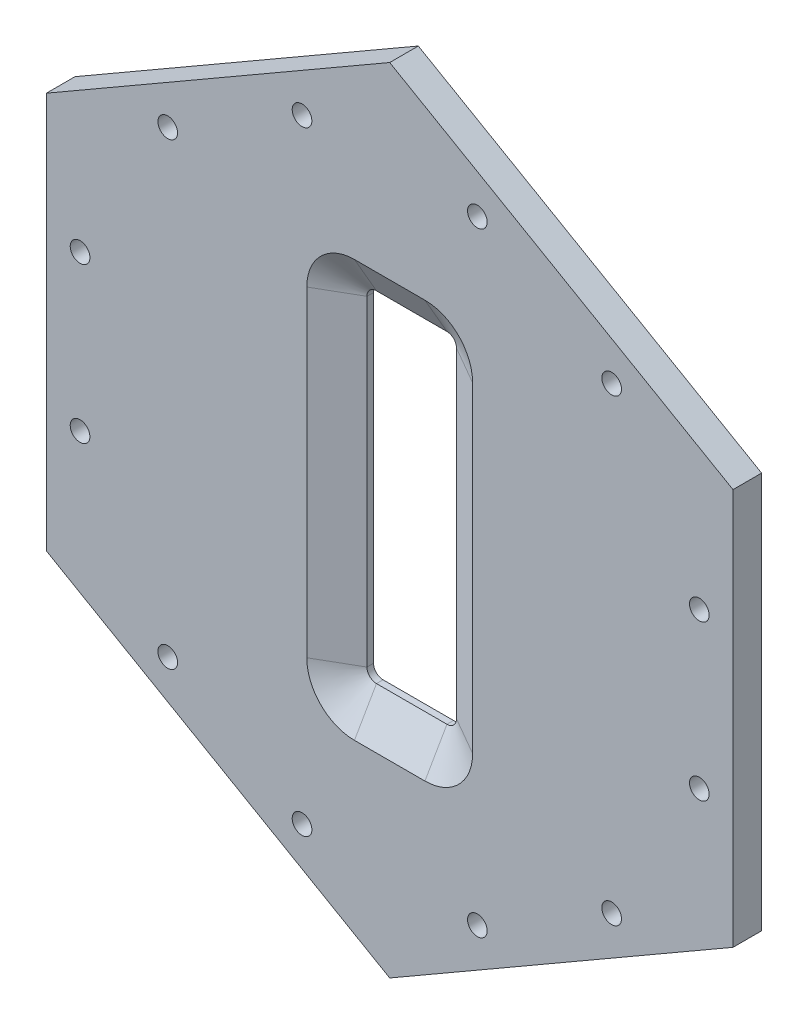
ISO-10303-21;
HEADER;
FILE_DESCRIPTION(('STEP AP214'),'2;1');
FILE_NAME('part.step','',(''),(''),'','','');
FILE_SCHEMA(('AUTOMOTIVE_DESIGN { 1 0 10303 214 1 1 1 1 }'));
ENDSEC;
DATA;
#1=APPLICATION_CONTEXT('core data for automotive mechanical design processes');
#2=APPLICATION_PROTOCOL_DEFINITION('international standard','automotive_design',2000,#1);
#3=PRODUCT_CONTEXT('',#1,'mechanical');
#4=PRODUCT('Part','Part','',(#3));
#5=PRODUCT_RELATED_PRODUCT_CATEGORY('part','',(#4));
#6=PRODUCT_DEFINITION_FORMATION('','',#4);
#7=PRODUCT_DEFINITION_CONTEXT('part definition',#1,'design');
#8=PRODUCT_DEFINITION('design','',#6,#7);
#9=PRODUCT_DEFINITION_SHAPE('','',#8);
#10=(LENGTH_UNIT() NAMED_UNIT(*) SI_UNIT(.MILLI.,.METRE.));
#11=(NAMED_UNIT(*) PLANE_ANGLE_UNIT() SI_UNIT($,.RADIAN.));
#12=(NAMED_UNIT(*) SI_UNIT($,.STERADIAN.) SOLID_ANGLE_UNIT());
#13=UNCERTAINTY_MEASURE_WITH_UNIT(LENGTH_MEASURE(1.E-05),#10,'distance_accuracy_value','');
#14=(GEOMETRIC_REPRESENTATION_CONTEXT(3) GLOBAL_UNCERTAINTY_ASSIGNED_CONTEXT((#13)) GLOBAL_UNIT_ASSIGNED_CONTEXT((#10,
#11,#12)) REPRESENTATION_CONTEXT('',''));
#15=CARTESIAN_POINT('',(0.,0.,0.));
#16=DIRECTION('',(0.,0.,1.));
#17=DIRECTION('',(1.,0.,0.));
#18=AXIS2_PLACEMENT_3D('',#15,#16,#17);
#19=CARTESIAN_POINT('',(-228.6,131.982271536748,-9.52500000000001));
#20=DIRECTION('',(-1.,0.,0.));
#21=DIRECTION('',(0.,-1.,0.));
#22=AXIS2_PLACEMENT_3D('',#19,#20,#21);
#23=PLANE('',#22);
#24=DIRECTION('',(0.,-1.,0.));
#25=VECTOR('',#24,1.);
#26=CARTESIAN_POINT('',(-228.6,131.982271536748,9.52500000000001));
#27=LINE('',#26,#25);
#28=CARTESIAN_POINT('',(-228.6,131.982271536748,9.52500000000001));
#29=VERTEX_POINT('',#28);
#30=CARTESIAN_POINT('',(-228.6,-131.982271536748,9.52500000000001));
#31=VERTEX_POINT('',#30);
#32=EDGE_CURVE('E346',#29,#31,#27,.T.);
#33=ORIENTED_EDGE('',*,*,#32,.F.);
#34=DIRECTION('',(0.,0.,1.));
#35=VECTOR('',#34,1.);
#36=CARTESIAN_POINT('',(-228.6,131.982271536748,-9.52500000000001));
#37=LINE('',#36,#35);
#38=CARTESIAN_POINT('',(-228.6,131.982271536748,-9.52500000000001));
#39=VERTEX_POINT('',#38);
#40=EDGE_CURVE('E395',#39,#29,#37,.T.);
#41=ORIENTED_EDGE('',*,*,#40,.F.);
#42=DIRECTION('',(0.,-1.,0.));
#43=VECTOR('',#42,1.);
#44=CARTESIAN_POINT('',(-228.6,131.982271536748,-9.52500000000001));
#45=LINE('',#44,#43);
#46=CARTESIAN_POINT('',(-228.6,-131.982271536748,-9.52500000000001));
#47=VERTEX_POINT('',#46);
#48=EDGE_CURVE('E347',#39,#47,#45,.T.);
#49=ORIENTED_EDGE('',*,*,#48,.T.);
#50=DIRECTION('',(0.,0.,1.));
#51=VECTOR('',#50,1.);
#52=CARTESIAN_POINT('',(-228.6,-131.982271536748,-9.52500000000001));
#53=LINE('',#52,#51);
#54=EDGE_CURVE('E372',#47,#31,#53,.T.);
#55=ORIENTED_EDGE('',*,*,#54,.T.);
#56=EDGE_LOOP('',(#33,#41,#49,#55));
#57=FACE_BOUND('',#56,.T.);
#58=ADVANCED_FACE('F45',(#57),#23,.T.);
#59=CARTESIAN_POINT('',(0.,263.964543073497,-9.52500000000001));
#60=DIRECTION('',(-0.5,0.866025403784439,0.));
#61=DIRECTION('',(-0.866025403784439,-0.5,0.));
#62=AXIS2_PLACEMENT_3D('',#59,#60,#61);
#63=PLANE('',#62);
#64=DIRECTION('',(-0.866025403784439,-0.5,0.));
#65=VECTOR('',#64,1.);
#66=CARTESIAN_POINT('',(0.,263.964543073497,9.52500000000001));
#67=LINE('',#66,#65);
#68=CARTESIAN_POINT('',(0.,263.964543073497,9.52500000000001));
#69=VERTEX_POINT('',#68);
#70=EDGE_CURVE('E352',#69,#29,#67,.T.);
#71=ORIENTED_EDGE('',*,*,#70,.F.);
#72=DIRECTION('',(0.,0.,1.));
#73=VECTOR('',#72,1.);
#74=CARTESIAN_POINT('',(0.,263.964543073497,-9.52500000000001));
#75=LINE('',#74,#73);
#76=CARTESIAN_POINT('',(0.,263.964543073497,-9.52500000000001));
#77=VERTEX_POINT('',#76);
#78=EDGE_CURVE('E398',#77,#69,#75,.T.);
#79=ORIENTED_EDGE('',*,*,#78,.F.);
#80=DIRECTION('',(-0.866025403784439,-0.5,0.));
#81=VECTOR('',#80,1.);
#82=CARTESIAN_POINT('',(0.,263.964543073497,-9.52500000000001));
#83=LINE('',#82,#81);
#84=EDGE_CURVE('E368',#77,#39,#83,.T.);
#85=ORIENTED_EDGE('',*,*,#84,.T.);
#86=ORIENTED_EDGE('',*,*,#40,.T.);
#87=EDGE_LOOP('',(#71,#79,#85,#86));
#88=FACE_BOUND('',#87,.T.);
#89=ADVANCED_FACE('F538',(#88),#63,.T.);
#90=CARTESIAN_POINT('',(228.6,131.982271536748,-9.52500000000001));
#91=DIRECTION('',(0.5,0.866025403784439,0.));
#92=DIRECTION('',(-0.866025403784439,0.5,0.));
#93=AXIS2_PLACEMENT_3D('',#90,#91,#92);
#94=PLANE('',#93);
#95=DIRECTION('',(-0.866025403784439,0.5,0.));
#96=VECTOR('',#95,1.);
#97=CARTESIAN_POINT('',(228.6,131.982271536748,9.52500000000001));
#98=LINE('',#97,#96);
#99=CARTESIAN_POINT('',(228.6,131.982271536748,9.52500000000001));
#100=VERTEX_POINT('',#99);
#101=EDGE_CURVE('E388',#100,#69,#98,.T.);
#102=ORIENTED_EDGE('',*,*,#101,.F.);
#103=DIRECTION('',(0.,0.,1.));
#104=VECTOR('',#103,1.);
#105=CARTESIAN_POINT('',(228.6,131.982271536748,-9.52500000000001));
#106=LINE('',#105,#104);
#107=CARTESIAN_POINT('',(228.6,131.982271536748,-9.52500000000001));
#108=VERTEX_POINT('',#107);
#109=EDGE_CURVE('E401',#108,#100,#106,.T.);
#110=ORIENTED_EDGE('',*,*,#109,.F.);
#111=DIRECTION('',(-0.866025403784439,0.5,0.));
#112=VECTOR('',#111,1.);
#113=CARTESIAN_POINT('',(228.6,131.982271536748,-9.52500000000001));
#114=LINE('',#113,#112);
#115=EDGE_CURVE('E364',#108,#77,#114,.T.);
#116=ORIENTED_EDGE('',*,*,#115,.T.);
#117=ORIENTED_EDGE('',*,*,#78,.T.);
#118=EDGE_LOOP('',(#102,#110,#116,#117));
#119=FACE_BOUND('',#118,.T.);
#120=ADVANCED_FACE('F545',(#119),#94,.T.);
#121=CARTESIAN_POINT('',(228.6,-131.982271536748,-9.52500000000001));
#122=DIRECTION('',(1.,0.,0.));
#123=DIRECTION('',(0.,0.,-1.));
#124=AXIS2_PLACEMENT_3D('',#121,#122,#123);
#125=PLANE('',#124);
#126=DIRECTION('',(0.,1.,0.));
#127=VECTOR('',#126,1.);
#128=CARTESIAN_POINT('',(228.6,-131.982271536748,9.52500000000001));
#129=LINE('',#128,#127);
#130=CARTESIAN_POINT('',(228.6,-131.982271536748,9.52500000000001));
#131=VERTEX_POINT('',#130);
#132=EDGE_CURVE('E384',#131,#100,#129,.T.);
#133=ORIENTED_EDGE('',*,*,#132,.F.);
#134=DIRECTION('',(0.,0.,1.));
#135=VECTOR('',#134,1.);
#136=CARTESIAN_POINT('',(228.6,-131.982271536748,-9.52500000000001));
#137=LINE('',#136,#135);
#138=CARTESIAN_POINT('',(228.6,-131.982271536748,-9.52500000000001));
#139=VERTEX_POINT('',#138);
#140=EDGE_CURVE('E404',#139,#131,#137,.T.);
#141=ORIENTED_EDGE('',*,*,#140,.F.);
#142=DIRECTION('',(0.,1.,0.));
#143=VECTOR('',#142,1.);
#144=CARTESIAN_POINT('',(228.6,-131.982271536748,-9.52500000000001));
#145=LINE('',#144,#143);
#146=EDGE_CURVE('E360',#139,#108,#145,.T.);
#147=ORIENTED_EDGE('',*,*,#146,.T.);
#148=ORIENTED_EDGE('',*,*,#109,.T.);
#149=EDGE_LOOP('',(#133,#141,#147,#148));
#150=FACE_BOUND('',#149,.T.);
#151=ADVANCED_FACE('F783',(#150),#125,.T.);
#152=CARTESIAN_POINT('',(0.,-263.964543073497,-9.52500000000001));
#153=DIRECTION('',(0.5,-0.866025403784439,0.));
#154=DIRECTION('',(0.866025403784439,0.5,0.));
#155=AXIS2_PLACEMENT_3D('',#152,#153,#154);
#156=PLANE('',#155);
#157=DIRECTION('',(0.866025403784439,0.5,0.));
#158=VECTOR('',#157,1.);
#159=CARTESIAN_POINT('',(0.,-263.964543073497,9.52500000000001));
#160=LINE('',#159,#158);
#161=CARTESIAN_POINT('',(0.,-263.964543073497,9.52500000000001));
#162=VERTEX_POINT('',#161);
#163=EDGE_CURVE('E380',#162,#131,#160,.T.);
#164=ORIENTED_EDGE('',*,*,#163,.F.);
#165=DIRECTION('',(0.,0.,1.));
#166=VECTOR('',#165,1.);
#167=CARTESIAN_POINT('',(0.,-263.964543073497,-9.52500000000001));
#168=LINE('',#167,#166);
#169=CARTESIAN_POINT('',(0.,-263.964543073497,-9.52500000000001));
#170=VERTEX_POINT('',#169);
#171=EDGE_CURVE('E407',#170,#162,#168,.T.);
#172=ORIENTED_EDGE('',*,*,#171,.F.);
#173=DIRECTION('',(0.866025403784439,0.5,0.));
#174=VECTOR('',#173,1.);
#175=CARTESIAN_POINT('',(0.,-263.964543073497,-9.52500000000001));
#176=LINE('',#175,#174);
#177=EDGE_CURVE('E356',#170,#139,#176,.T.);
#178=ORIENTED_EDGE('',*,*,#177,.T.);
#179=ORIENTED_EDGE('',*,*,#140,.T.);
#180=EDGE_LOOP('',(#164,#172,#178,#179));
#181=FACE_BOUND('',#180,.T.);
#182=ADVANCED_FACE('F776',(#181),#156,.T.);
#183=CARTESIAN_POINT('',(-228.6,-131.982271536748,-9.52500000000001));
#184=DIRECTION('',(-0.5,-0.866025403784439,0.));
#185=DIRECTION('',(0.866025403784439,-0.5,0.));
#186=AXIS2_PLACEMENT_3D('',#183,#184,#185);
#187=PLANE('',#186);
#188=DIRECTION('',(0.866025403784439,-0.5,0.));
#189=VECTOR('',#188,1.);
#190=CARTESIAN_POINT('',(-228.6,-131.982271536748,9.52500000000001));
#191=LINE('',#190,#189);
#192=EDGE_CURVE('E376',#31,#162,#191,.T.);
#193=ORIENTED_EDGE('',*,*,#192,.F.);
#194=ORIENTED_EDGE('',*,*,#54,.F.);
#195=DIRECTION('',(0.866025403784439,-0.5,0.));
#196=VECTOR('',#195,1.);
#197=CARTESIAN_POINT('',(-228.6,-131.982271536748,-9.52500000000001));
#198=LINE('',#197,#196);
#199=EDGE_CURVE('E351',#47,#170,#198,.T.);
#200=ORIENTED_EDGE('',*,*,#199,.T.);
#201=ORIENTED_EDGE('',*,*,#171,.T.);
#202=EDGE_LOOP('',(#193,#194,#200,#201));
#203=FACE_BOUND('',#202,.T.);
#204=ADVANCED_FACE('F551',(#203),#187,.T.);
#205=CARTESIAN_POINT('',(0.,0.,-9.52500000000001));
#206=DIRECTION('',(0.,0.,1.));
#207=DIRECTION('',(1.,0.,0.));
#208=AXIS2_PLACEMENT_3D('',#205,#206,#207);
#209=PLANE('',#208);
#210=DIRECTION('',(0.,-1.,0.));
#211=VECTOR('',#210,1.);
#212=CARTESIAN_POINT('',(-29.8149992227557,106.900009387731,-9.52500000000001));
#213=LINE('',#212,#211);
#214=CARTESIAN_POINT('',(-29.8149992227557,106.900009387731,-9.52500000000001));
#215=VERTEX_POINT('',#214);
#216=CARTESIAN_POINT('',(-29.8149992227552,-106.900009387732,-9.52500000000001));
#217=VERTEX_POINT('',#216);
#218=EDGE_CURVE('E186',#215,#217,#213,.T.);
#219=ORIENTED_EDGE('',*,*,#218,.T.);
#220=CARTESIAN_POINT('',(-23.4649992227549,-106.900009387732,-9.52500000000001));
#221=DIRECTION('',(0.,0.,1.));
#222=DIRECTION('',(-1.,0.,0.));
#223=AXIS2_PLACEMENT_3D('',#220,#221,#222);
#224=CIRCLE('',#223,6.34999999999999);
#225=CARTESIAN_POINT('',(-23.4649992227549,-113.250009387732,-9.52500000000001));
#226=VERTEX_POINT('',#225);
#227=EDGE_CURVE('E179',#217,#226,#224,.T.);
#228=ORIENTED_EDGE('',*,*,#227,.T.);
#229=DIRECTION('',(1.,0.,0.));
#230=VECTOR('',#229,1.);
#231=CARTESIAN_POINT('',(-23.4649992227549,-113.250009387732,-9.52500000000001));
#232=LINE('',#231,#230);
#233=CARTESIAN_POINT('',(23.4649992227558,-113.250009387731,-9.52500000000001));
#234=VERTEX_POINT('',#233);
#235=EDGE_CURVE('E190',#226,#234,#232,.T.);
#236=ORIENTED_EDGE('',*,*,#235,.T.);
#237=CARTESIAN_POINT('',(23.4649992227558,-106.900009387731,-9.52500000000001));
#238=DIRECTION('',(0.,0.,1.));
#239=DIRECTION('',(1.,0.,0.));
#240=AXIS2_PLACEMENT_3D('',#237,#238,#239);
#241=CIRCLE('',#240,6.35);
#242=CARTESIAN_POINT('',(29.8149992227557,-106.900009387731,-9.52500000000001));
#243=VERTEX_POINT('',#242);
#244=EDGE_CURVE('E196',#234,#243,#241,.T.);
#245=ORIENTED_EDGE('',*,*,#244,.T.);
#246=DIRECTION('',(0.,1.,0.));
#247=VECTOR('',#246,1.);
#248=CARTESIAN_POINT('',(29.8149992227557,-106.900009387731,-9.52500000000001));
#249=LINE('',#248,#247);
#250=CARTESIAN_POINT('',(29.8149992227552,106.900009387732,-9.52500000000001));
#251=VERTEX_POINT('',#250);
#252=EDGE_CURVE('E211',#243,#251,#249,.T.);
#253=ORIENTED_EDGE('',*,*,#252,.T.);
#254=CARTESIAN_POINT('',(23.4649992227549,106.900009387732,-9.52500000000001));
#255=DIRECTION('',(0.,0.,1.));
#256=DIRECTION('',(1.,0.,0.));
#257=AXIS2_PLACEMENT_3D('',#254,#255,#256);
#258=CIRCLE('',#257,6.34999999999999);
#259=CARTESIAN_POINT('',(23.4649992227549,113.250009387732,-9.52500000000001));
#260=VERTEX_POINT('',#259);
#261=EDGE_CURVE('E215',#251,#260,#258,.T.);
#262=ORIENTED_EDGE('',*,*,#261,.T.);
#263=DIRECTION('',(-1.,0.,0.));
#264=VECTOR('',#263,1.);
#265=CARTESIAN_POINT('',(23.4649992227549,113.250009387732,-9.52500000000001));
#266=LINE('',#265,#264);
#267=CARTESIAN_POINT('',(-23.4649992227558,113.250009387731,-9.52500000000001));
#268=VERTEX_POINT('',#267);
#269=EDGE_CURVE('E219',#260,#268,#266,.T.);
#270=ORIENTED_EDGE('',*,*,#269,.T.);
#271=CARTESIAN_POINT('',(-23.4649992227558,106.900009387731,-9.52500000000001));
#272=DIRECTION('',(0.,0.,1.));
#273=DIRECTION('',(1.,0.,0.));
#274=AXIS2_PLACEMENT_3D('',#271,#272,#273);
#275=CIRCLE('',#274,6.35);
#276=EDGE_CURVE('E223',#268,#215,#275,.T.);
#277=ORIENTED_EDGE('',*,*,#276,.T.);
#278=EDGE_LOOP('',(#219,#228,#236,#245,#253,#262,#270,#277));
#279=FACE_BOUND('',#278,.T.);
#280=CARTESIAN_POINT('',(-58.378341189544,-204.367436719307,-9.52500000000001));
#281=DIRECTION('',(0.,0.,1.));
#282=DIRECTION('',(1.,0.,0.));
#283=AXIS2_PLACEMENT_3D('',#280,#281,#282);
#284=CIRCLE('',#283,6.54843750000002);
#285=CARTESIAN_POINT('',(-51.829903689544,-204.367436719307,-9.52500000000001));
#286=VERTEX_POINT('',#285);
#287=EDGE_CURVE('E291',#286,#286,#284,.T.);
#288=ORIENTED_EDGE('',*,*,#287,.T.);
#289=EDGE_LOOP('',(#288));
#290=FACE_BOUND('',#289,.T.);
#291=CARTESIAN_POINT('',(-206.1765625,51.6265918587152,-9.52500000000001));
#292=DIRECTION('',(0.,0.,1.));
#293=DIRECTION('',(1.,0.,0.));
#294=AXIS2_PLACEMENT_3D('',#291,#292,#293);
#295=CIRCLE('',#294,6.5484375);
#296=CARTESIAN_POINT('',(-199.628125,51.6265918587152,-9.52500000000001));
#297=VERTEX_POINT('',#296);
#298=EDGE_CURVE('E284',#297,#297,#295,.T.);
#299=ORIENTED_EDGE('',*,*,#298,.T.);
#300=EDGE_LOOP('',(#299));
#301=FACE_BOUND('',#300,.T.);
#302=CARTESIAN_POINT('',(-206.1765625,-51.6265918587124,-9.52500000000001));
#303=DIRECTION('',(0.,0.,1.));
#304=DIRECTION('',(1.,0.,0.));
#305=AXIS2_PLACEMENT_3D('',#302,#303,#304);
#306=CIRCLE('',#305,6.5484375);
#307=CARTESIAN_POINT('',(-199.628125,-51.6265918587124,-9.52500000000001));
#308=VERTEX_POINT('',#307);
#309=EDGE_CURVE('E275',#308,#308,#306,.T.);
#310=ORIENTED_EDGE('',*,*,#309,.T.);
#311=EDGE_LOOP('',(#310));
#312=FACE_BOUND('',#311,.T.);
#313=CARTESIAN_POINT('',(-58.3783411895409,204.367436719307,-9.52500000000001));
#314=DIRECTION('',(0.,0.,1.));
#315=DIRECTION('',(1.,0.,0.));
#316=AXIS2_PLACEMENT_3D('',#313,#314,#315);
#317=CIRCLE('',#316,6.5484375);
#318=CARTESIAN_POINT('',(-51.8299036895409,204.367436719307,-9.52500000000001));
#319=VERTEX_POINT('',#318);
#320=EDGE_CURVE('E260',#319,#319,#317,.T.);
#321=ORIENTED_EDGE('',*,*,#320,.T.);
#322=EDGE_LOOP('',(#321));
#323=FACE_BOUND('',#322,.T.);
#324=CARTESIAN_POINT('',(206.1765625,51.6265918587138,-9.52500000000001));
#325=DIRECTION('',(0.,0.,1.));
#326=DIRECTION('',(1.,0.,0.));
#327=AXIS2_PLACEMENT_3D('',#324,#325,#326);
#328=CIRCLE('',#327,6.5484375);
#329=CARTESIAN_POINT('',(212.725,51.6265918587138,-9.52500000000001));
#330=VERTEX_POINT('',#329);
#331=EDGE_CURVE('E323',#330,#330,#328,.T.);
#332=ORIENTED_EDGE('',*,*,#331,.T.);
#333=EDGE_LOOP('',(#332));
#334=FACE_BOUND('',#333,.T.);
#335=CARTESIAN_POINT('',(58.3783411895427,-204.367436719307,-9.52500000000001));
#336=DIRECTION('',(0.,0.,1.));
#337=DIRECTION('',(1.,0.,0.));
#338=AXIS2_PLACEMENT_3D('',#335,#336,#337);
#339=CIRCLE('',#338,6.54843750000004);
#340=CARTESIAN_POINT('',(64.9267786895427,-204.367436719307,-9.52500000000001));
#341=VERTEX_POINT('',#340);
#342=EDGE_CURVE('E316',#341,#341,#339,.T.);
#343=ORIENTED_EDGE('',*,*,#342,.T.);
#344=EDGE_LOOP('',(#343));
#345=FACE_BOUND('',#344,.T.);
#346=CARTESIAN_POINT('',(147.798221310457,-152.740844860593,-9.52500000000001));
#347=DIRECTION('',(0.,0.,1.));
#348=DIRECTION('',(1.,0.,0.));
#349=AXIS2_PLACEMENT_3D('',#346,#347,#348);
#350=CIRCLE('',#349,6.54843750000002);
#351=CARTESIAN_POINT('',(154.346658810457,-152.740844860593,-9.52500000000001));
#352=VERTEX_POINT('',#351);
#353=EDGE_CURVE('E307',#352,#352,#350,.T.);
#354=ORIENTED_EDGE('',*,*,#353,.T.);
#355=EDGE_LOOP('',(#354));
#356=FACE_BOUND('',#355,.T.);
#357=CARTESIAN_POINT('',(-147.798221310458,-152.740844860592,-9.52500000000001));
#358=DIRECTION('',(0.,0.,1.));
#359=DIRECTION('',(1.,0.,0.));
#360=AXIS2_PLACEMENT_3D('',#357,#358,#359);
#361=CIRCLE('',#360,6.54843750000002);
#362=CARTESIAN_POINT('',(-141.249783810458,-152.740844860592,-9.52500000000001));
#363=VERTEX_POINT('',#362);
#364=EDGE_CURVE('E300',#363,#363,#361,.T.);
#365=ORIENTED_EDGE('',*,*,#364,.T.);
#366=EDGE_LOOP('',(#365));
#367=FACE_BOUND('',#366,.T.);
#368=CARTESIAN_POINT('',(-147.798221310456,152.740844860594,-9.52500000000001));
#369=DIRECTION('',(0.,0.,1.));
#370=DIRECTION('',(1.,0.,0.));
#371=AXIS2_PLACEMENT_3D('',#368,#369,#370);
#372=CIRCLE('',#371,6.54843750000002);
#373=CARTESIAN_POINT('',(-141.249783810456,152.740844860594,-9.52500000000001));
#374=VERTEX_POINT('',#373);
#375=EDGE_CURVE('E251',#374,#374,#372,.T.);
#376=ORIENTED_EDGE('',*,*,#375,.T.);
#377=EDGE_LOOP('',(#376));
#378=FACE_BOUND('',#377,.T.);
#379=CARTESIAN_POINT('',(147.798221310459,152.740844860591,-9.52500000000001));
#380=DIRECTION('',(0.,0.,1.));
#381=DIRECTION('',(1.,0.,0.));
#382=AXIS2_PLACEMENT_3D('',#379,#380,#381);
#383=CIRCLE('',#382,6.5484375);
#384=CARTESIAN_POINT('',(154.346658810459,152.740844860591,-9.52500000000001));
#385=VERTEX_POINT('',#384);
#386=EDGE_CURVE('E261',#385,#385,#383,.T.);
#387=ORIENTED_EDGE('',*,*,#386,.T.);
#388=EDGE_LOOP('',(#387));
#389=FACE_BOUND('',#388,.T.);
#390=CARTESIAN_POINT('',(58.3783411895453,204.367436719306,-9.52500000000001));
#391=DIRECTION('',(0.,0.,1.));
#392=DIRECTION('',(1.,0.,0.));
#393=AXIS2_PLACEMENT_3D('',#390,#391,#392);
#394=CIRCLE('',#393,6.5484375);
#395=CARTESIAN_POINT('',(64.9267786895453,204.367436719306,-9.52500000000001));
#396=VERTEX_POINT('',#395);
#397=EDGE_CURVE('E231',#396,#396,#394,.T.);
#398=ORIENTED_EDGE('',*,*,#397,.T.);
#399=EDGE_LOOP('',(#398));
#400=FACE_BOUND('',#399,.T.);
#401=CARTESIAN_POINT('',(206.1765625,-51.6265918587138,-9.52500000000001));
#402=DIRECTION('',(0.,0.,1.));
#403=DIRECTION('',(1.,0.,0.));
#404=AXIS2_PLACEMENT_3D('',#401,#402,#403);
#405=CIRCLE('',#404,6.5484375);
#406=CARTESIAN_POINT('',(212.725,-51.6265918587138,-9.52500000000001));
#407=VERTEX_POINT('',#406);
#408=EDGE_CURVE('E342',#407,#407,#405,.T.);
#409=ORIENTED_EDGE('',*,*,#408,.T.);
#410=EDGE_LOOP('',(#409));
#411=FACE_BOUND('',#410,.T.);
#412=ORIENTED_EDGE('',*,*,#48,.F.);
#413=ORIENTED_EDGE('',*,*,#84,.F.);
#414=ORIENTED_EDGE('',*,*,#115,.F.);
#415=ORIENTED_EDGE('',*,*,#146,.F.);
#416=ORIENTED_EDGE('',*,*,#177,.F.);
#417=ORIENTED_EDGE('',*,*,#199,.F.);
#418=EDGE_LOOP('',(#412,#413,#414,#415,#416,#417));
#419=FACE_BOUND('',#418,.T.);
#420=ADVANCED_FACE('F198',(#279,#290,#301,#312,#323,#334,#345,#356,#367,#378,#389,#400,#411,
#419),#209,.F.);
#421=CARTESIAN_POINT('',(0.,0.,9.52500000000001));
#422=DIRECTION('',(0.,0.,1.));
#423=DIRECTION('',(1.,0.,0.));
#424=AXIS2_PLACEMENT_3D('',#421,#422,#423);
#425=PLANE('',#424);
#426=DIRECTION('',(-1.,0.,0.));
#427=VECTOR('',#426,1.);
#428=CARTESIAN_POINT('',(-23.4649992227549,-138.650009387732,9.52500000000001));
#429=LINE('',#428,#427);
#430=CARTESIAN_POINT('',(23.4649992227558,-138.650009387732,9.52500000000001));
#431=VERTEX_POINT('',#430);
#432=CARTESIAN_POINT('',(-23.4649992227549,-138.650009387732,9.52500000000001));
#433=VERTEX_POINT('',#432);
#434=EDGE_CURVE('E432',#431,#433,#429,.T.);
#435=ORIENTED_EDGE('',*,*,#434,.T.);
#436=CARTESIAN_POINT('',(-23.4649992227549,-106.900009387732,9.52500000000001));
#437=DIRECTION('',(0.,0.,1.));
#438=DIRECTION('',(1.,0.,0.));
#439=AXIS2_PLACEMENT_3D('',#436,#437,#438);
#440=CIRCLE('',#439,31.7500000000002);
#441=CARTESIAN_POINT('',(-55.2149992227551,-106.900009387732,9.52500000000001));
#442=VERTEX_POINT('',#441);
#443=EDGE_CURVE('E435',#433,#442,#440,.F.);
#444=ORIENTED_EDGE('',*,*,#443,.T.);
#445=DIRECTION('',(0.,1.,0.));
#446=VECTOR('',#445,1.);
#447=CARTESIAN_POINT('',(-55.214999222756,106.900009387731,9.52500000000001));
#448=LINE('',#447,#446);
#449=CARTESIAN_POINT('',(-55.214999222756,106.900009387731,9.52500000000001));
#450=VERTEX_POINT('',#449);
#451=EDGE_CURVE('E414',#442,#450,#448,.T.);
#452=ORIENTED_EDGE('',*,*,#451,.T.);
#453=CARTESIAN_POINT('',(-23.4649992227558,106.900009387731,9.52500000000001));
#454=DIRECTION('',(0.,0.,1.));
#455=DIRECTION('',(1.,0.,0.));
#456=AXIS2_PLACEMENT_3D('',#453,#454,#455);
#457=CIRCLE('',#456,31.7500000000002);
#458=CARTESIAN_POINT('',(-23.4649992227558,138.650009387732,9.52500000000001));
#459=VERTEX_POINT('',#458);
#460=EDGE_CURVE('E417',#450,#459,#457,.F.);
#461=ORIENTED_EDGE('',*,*,#460,.T.);
#462=DIRECTION('',(1.,0.,0.));
#463=VECTOR('',#462,1.);
#464=CARTESIAN_POINT('',(23.4649992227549,138.650009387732,9.52500000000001));
#465=LINE('',#464,#463);
#466=CARTESIAN_POINT('',(23.4649992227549,138.650009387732,9.52500000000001));
#467=VERTEX_POINT('',#466);
#468=EDGE_CURVE('E420',#459,#467,#465,.T.);
#469=ORIENTED_EDGE('',*,*,#468,.T.);
#470=CARTESIAN_POINT('',(23.4649992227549,106.900009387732,9.52500000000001));
#471=DIRECTION('',(0.,0.,1.));
#472=DIRECTION('',(1.,0.,0.));
#473=AXIS2_PLACEMENT_3D('',#470,#471,#472);
#474=CIRCLE('',#473,31.7500000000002);
#475=CARTESIAN_POINT('',(55.2149992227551,106.900009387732,9.52500000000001));
#476=VERTEX_POINT('',#475);
#477=EDGE_CURVE('E423',#467,#476,#474,.F.);
#478=ORIENTED_EDGE('',*,*,#477,.T.);
#479=DIRECTION('',(0.,-1.,0.));
#480=VECTOR('',#479,1.);
#481=CARTESIAN_POINT('',(55.214999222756,-106.900009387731,9.52500000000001));
#482=LINE('',#481,#480);
#483=CARTESIAN_POINT('',(55.214999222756,-106.900009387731,9.52500000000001));
#484=VERTEX_POINT('',#483);
#485=EDGE_CURVE('E426',#476,#484,#482,.T.);
#486=ORIENTED_EDGE('',*,*,#485,.T.);
#487=CARTESIAN_POINT('',(23.4649992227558,-106.900009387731,9.52500000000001));
#488=DIRECTION('',(0.,0.,1.));
#489=DIRECTION('',(1.,0.,0.));
#490=AXIS2_PLACEMENT_3D('',#487,#488,#489);
#491=CIRCLE('',#490,31.7500000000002);
#492=EDGE_CURVE('E429',#484,#431,#491,.F.);
#493=ORIENTED_EDGE('',*,*,#492,.T.);
#494=EDGE_LOOP('',(#435,#444,#452,#461,#469,#478,#486,#493));
#495=FACE_BOUND('',#494,.T.);
#496=CARTESIAN_POINT('',(-58.378341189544,-204.367436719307,9.52500000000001));
#497=DIRECTION('',(0.,0.,1.));
#498=DIRECTION('',(1.,0.,0.));
#499=AXIS2_PLACEMENT_3D('',#496,#497,#498);
#500=CIRCLE('',#499,6.54843750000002);
#501=CARTESIAN_POINT('',(-51.829903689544,-204.367436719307,9.525));
#502=VERTEX_POINT('',#501);
#503=EDGE_CURVE('E295',#502,#502,#500,.T.);
#504=ORIENTED_EDGE('',*,*,#503,.F.);
#505=EDGE_LOOP('',(#504));
#506=FACE_BOUND('',#505,.T.);
#507=CARTESIAN_POINT('',(-206.1765625,51.6265918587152,9.52500000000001));
#508=DIRECTION('',(0.,0.,1.));
#509=DIRECTION('',(1.,0.,0.));
#510=AXIS2_PLACEMENT_3D('',#507,#508,#509);
#511=CIRCLE('',#510,6.5484375);
#512=CARTESIAN_POINT('',(-199.628125,51.6265918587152,9.525));
#513=VERTEX_POINT('',#512);
#514=EDGE_CURVE('E296',#513,#513,#511,.T.);
#515=ORIENTED_EDGE('',*,*,#514,.F.);
#516=EDGE_LOOP('',(#515));
#517=FACE_BOUND('',#516,.T.);
#518=CARTESIAN_POINT('',(-206.1765625,-51.6265918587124,9.52500000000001));
#519=DIRECTION('',(0.,0.,1.));
#520=DIRECTION('',(1.,0.,0.));
#521=AXIS2_PLACEMENT_3D('',#518,#519,#520);
#522=CIRCLE('',#521,6.5484375);
#523=CARTESIAN_POINT('',(-199.628125,-51.6265918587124,9.525));
#524=VERTEX_POINT('',#523);
#525=EDGE_CURVE('E279',#524,#524,#522,.T.);
#526=ORIENTED_EDGE('',*,*,#525,.F.);
#527=EDGE_LOOP('',(#526));
#528=FACE_BOUND('',#527,.T.);
#529=CARTESIAN_POINT('',(-58.3783411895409,204.367436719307,9.52500000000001));
#530=DIRECTION('',(0.,0.,1.));
#531=DIRECTION('',(1.,0.,0.));
#532=AXIS2_PLACEMENT_3D('',#529,#530,#531);
#533=CIRCLE('',#532,6.5484375);
#534=CARTESIAN_POINT('',(-51.8299036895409,204.367436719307,9.525));
#535=VERTEX_POINT('',#534);
#536=EDGE_CURVE('E280',#535,#535,#533,.T.);
#537=ORIENTED_EDGE('',*,*,#536,.F.);
#538=EDGE_LOOP('',(#537));
#539=FACE_BOUND('',#538,.T.);
#540=CARTESIAN_POINT('',(206.1765625,51.6265918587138,9.52500000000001));
#541=DIRECTION('',(0.,0.,1.));
#542=DIRECTION('',(1.,0.,0.));
#543=AXIS2_PLACEMENT_3D('',#540,#541,#542);
#544=CIRCLE('',#543,6.5484375);
#545=CARTESIAN_POINT('',(212.725,51.6265918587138,9.525));
#546=VERTEX_POINT('',#545);
#547=EDGE_CURVE('E327',#546,#546,#544,.T.);
#548=ORIENTED_EDGE('',*,*,#547,.F.);
#549=EDGE_LOOP('',(#548));
#550=FACE_BOUND('',#549,.T.);
#551=CARTESIAN_POINT('',(58.3783411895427,-204.367436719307,9.52500000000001));
#552=DIRECTION('',(0.,0.,1.));
#553=DIRECTION('',(1.,0.,0.));
#554=AXIS2_PLACEMENT_3D('',#551,#552,#553);
#555=CIRCLE('',#554,6.54843750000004);
#556=CARTESIAN_POINT('',(64.9267786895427,-204.367436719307,9.525));
#557=VERTEX_POINT('',#556);
#558=EDGE_CURVE('E328',#557,#557,#555,.T.);
#559=ORIENTED_EDGE('',*,*,#558,.F.);
#560=EDGE_LOOP('',(#559));
#561=FACE_BOUND('',#560,.T.);
#562=CARTESIAN_POINT('',(147.798221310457,-152.740844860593,9.52500000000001));
#563=DIRECTION('',(0.,0.,1.));
#564=DIRECTION('',(1.,0.,0.));
#565=AXIS2_PLACEMENT_3D('',#562,#563,#564);
#566=CIRCLE('',#565,6.54843750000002);
#567=CARTESIAN_POINT('',(154.346658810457,-152.740844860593,9.525));
#568=VERTEX_POINT('',#567);
#569=EDGE_CURVE('E311',#568,#568,#566,.T.);
#570=ORIENTED_EDGE('',*,*,#569,.F.);
#571=EDGE_LOOP('',(#570));
#572=FACE_BOUND('',#571,.T.);
#573=CARTESIAN_POINT('',(-147.798221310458,-152.740844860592,9.52500000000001));
#574=DIRECTION('',(0.,0.,1.));
#575=DIRECTION('',(1.,0.,0.));
#576=AXIS2_PLACEMENT_3D('',#573,#574,#575);
#577=CIRCLE('',#576,6.54843750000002);
#578=CARTESIAN_POINT('',(-141.249783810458,-152.740844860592,9.525));
#579=VERTEX_POINT('',#578);
#580=EDGE_CURVE('E312',#579,#579,#577,.T.);
#581=ORIENTED_EDGE('',*,*,#580,.F.);
#582=EDGE_LOOP('',(#581));
#583=FACE_BOUND('',#582,.T.);
#584=CARTESIAN_POINT('',(-147.798221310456,152.740844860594,9.52500000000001));
#585=DIRECTION('',(0.,0.,1.));
#586=DIRECTION('',(1.,0.,0.));
#587=AXIS2_PLACEMENT_3D('',#584,#585,#586);
#588=CIRCLE('',#587,6.54843750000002);
#589=CARTESIAN_POINT('',(-141.249783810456,152.740844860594,9.525));
#590=VERTEX_POINT('',#589);
#591=EDGE_CURVE('E255',#590,#590,#588,.T.);
#592=ORIENTED_EDGE('',*,*,#591,.F.);
#593=EDGE_LOOP('',(#592));
#594=FACE_BOUND('',#593,.T.);
#595=CARTESIAN_POINT('',(147.798221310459,152.740844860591,9.52500000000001));
#596=DIRECTION('',(0.,0.,1.));
#597=DIRECTION('',(1.,0.,0.));
#598=AXIS2_PLACEMENT_3D('',#595,#596,#597);
#599=CIRCLE('',#598,6.5484375);
#600=CARTESIAN_POINT('',(154.346658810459,152.740844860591,9.525));
#601=VERTEX_POINT('',#600);
#602=EDGE_CURVE('E256',#601,#601,#599,.T.);
#603=ORIENTED_EDGE('',*,*,#602,.F.);
#604=EDGE_LOOP('',(#603));
#605=FACE_BOUND('',#604,.T.);
#606=CARTESIAN_POINT('',(58.3783411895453,204.367436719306,9.52500000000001));
#607=DIRECTION('',(0.,0.,1.));
#608=DIRECTION('',(1.,0.,0.));
#609=AXIS2_PLACEMENT_3D('',#606,#607,#608);
#610=CIRCLE('',#609,6.5484375);
#611=CARTESIAN_POINT('',(64.9267786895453,204.367436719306,9.525));
#612=VERTEX_POINT('',#611);
#613=EDGE_CURVE('E265',#612,#612,#610,.T.);
#614=ORIENTED_EDGE('',*,*,#613,.F.);
#615=EDGE_LOOP('',(#614));
#616=FACE_BOUND('',#615,.T.);
#617=CARTESIAN_POINT('',(206.1765625,-51.6265918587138,9.52500000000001));
#618=DIRECTION('',(0.,0.,1.));
#619=DIRECTION('',(1.,0.,0.));
#620=AXIS2_PLACEMENT_3D('',#617,#618,#619);
#621=CIRCLE('',#620,6.5484375);
#622=CARTESIAN_POINT('',(212.725,-51.6265918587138,9.525));
#623=VERTEX_POINT('',#622);
#624=EDGE_CURVE('E332',#623,#623,#621,.T.);
#625=ORIENTED_EDGE('',*,*,#624,.F.);
#626=EDGE_LOOP('',(#625));
#627=FACE_BOUND('',#626,.T.);
#628=ORIENTED_EDGE('',*,*,#32,.T.);
#629=ORIENTED_EDGE('',*,*,#192,.T.);
#630=ORIENTED_EDGE('',*,*,#163,.T.);
#631=ORIENTED_EDGE('',*,*,#132,.T.);
#632=ORIENTED_EDGE('',*,*,#101,.T.);
#633=ORIENTED_EDGE('',*,*,#70,.T.);
#634=EDGE_LOOP('',(#628,#629,#630,#631,#632,#633));
#635=FACE_BOUND('',#634,.T.);
#636=ADVANCED_FACE('F512',(#495,#506,#517,#528,#539,#550,#561,#572,#583,#594,#605,#616,#627,
#635),#425,.T.);
#637=CARTESIAN_POINT('',(206.1765625,-51.6265918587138,-9.52500000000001));
#638=DIRECTION('',(0.,0.,1.));
#639=DIRECTION('',(1.,0.,0.));
#640=AXIS2_PLACEMENT_3D('',#637,#638,#639);
#641=CYLINDRICAL_SURFACE('',#640,6.5484375);
#642=CARTESIAN_POINT('',(212.725,-51.6265918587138,-9.52500000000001));
#643=CARTESIAN_POINT('',(212.725,-51.6265918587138,-9.32656250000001));
#644=CARTESIAN_POINT('',(212.725,-51.6265918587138,-9.12812500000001));
#645=CARTESIAN_POINT('',(212.725,-51.6265918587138,-8.73125000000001));
#646=CARTESIAN_POINT('',(212.725,-51.6265918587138,-8.53281250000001));
#647=CARTESIAN_POINT('',(212.725,-51.6265918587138,-8.13593750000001));
#648=CARTESIAN_POINT('',(212.725,-51.6265918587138,-7.93750000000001));
#649=CARTESIAN_POINT('',(212.725,-51.6265918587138,-7.54062500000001));
#650=CARTESIAN_POINT('',(212.725,-51.6265918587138,-7.34218750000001));
#651=CARTESIAN_POINT('',(212.725,-51.6265918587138,-6.94531250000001));
#652=CARTESIAN_POINT('',(212.725,-51.6265918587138,-6.74687500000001));
#653=CARTESIAN_POINT('',(212.725,-51.6265918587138,-6.35000000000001));
#654=CARTESIAN_POINT('',(212.725,-51.6265918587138,-6.15156250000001));
#655=CARTESIAN_POINT('',(212.725,-51.6265918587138,-5.75468750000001));
#656=CARTESIAN_POINT('',(212.725,-51.6265918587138,-5.55625));
#657=CARTESIAN_POINT('',(212.725,-51.6265918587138,-5.15937500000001));
#658=CARTESIAN_POINT('',(212.725,-51.6265918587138,-4.9609375));
#659=CARTESIAN_POINT('',(212.725,-51.6265918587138,-4.5640625));
#660=CARTESIAN_POINT('',(212.725,-51.6265918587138,-4.365625));
#661=CARTESIAN_POINT('',(212.725,-51.6265918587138,-3.96875));
#662=CARTESIAN_POINT('',(212.725,-51.6265918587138,-3.7703125));
#663=CARTESIAN_POINT('',(212.725,-51.6265918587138,-3.3734375));
#664=CARTESIAN_POINT('',(212.725,-51.6265918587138,-3.175));
#665=CARTESIAN_POINT('',(212.725,-51.6265918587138,-2.778125));
#666=CARTESIAN_POINT('',(212.725,-51.6265918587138,-2.5796875));
#667=CARTESIAN_POINT('',(212.725,-51.6265918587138,-2.1828125));
#668=CARTESIAN_POINT('',(212.725,-51.6265918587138,-1.984375));
#669=CARTESIAN_POINT('',(212.725,-51.6265918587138,-1.5875));
#670=CARTESIAN_POINT('',(212.725,-51.6265918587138,-1.3890625));
#671=CARTESIAN_POINT('',(212.725,-51.6265918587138,-0.992187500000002));
#672=CARTESIAN_POINT('',(212.725,-51.6265918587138,-0.793750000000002));
#673=CARTESIAN_POINT('',(212.725,-51.6265918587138,-0.396875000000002));
#674=CARTESIAN_POINT('',(212.725,-51.6265918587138,-0.198437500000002));
#675=CARTESIAN_POINT('',(212.725,-51.6265918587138,0.198437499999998));
#676=CARTESIAN_POINT('',(212.725,-51.6265918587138,0.396874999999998));
#677=CARTESIAN_POINT('',(212.725,-51.6265918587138,0.793749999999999));
#678=CARTESIAN_POINT('',(212.725,-51.6265918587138,0.992187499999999));
#679=CARTESIAN_POINT('',(212.725,-51.6265918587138,1.3890625));
#680=CARTESIAN_POINT('',(212.725,-51.6265918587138,1.5875));
#681=CARTESIAN_POINT('',(212.725,-51.6265918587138,1.984375));
#682=CARTESIAN_POINT('',(212.725,-51.6265918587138,2.1828125));
#683=CARTESIAN_POINT('',(212.725,-51.6265918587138,2.5796875));
#684=CARTESIAN_POINT('',(212.725,-51.6265918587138,2.778125));
#685=CARTESIAN_POINT('',(212.725,-51.6265918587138,3.175));
#686=CARTESIAN_POINT('',(212.725,-51.6265918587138,3.3734375));
#687=CARTESIAN_POINT('',(212.725,-51.6265918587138,3.7703125));
#688=CARTESIAN_POINT('',(212.725,-51.6265918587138,3.96875));
#689=CARTESIAN_POINT('',(212.725,-51.6265918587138,4.365625));
#690=CARTESIAN_POINT('',(212.725,-51.6265918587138,4.5640625));
#691=CARTESIAN_POINT('',(212.725,-51.6265918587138,4.9609375));
#692=CARTESIAN_POINT('',(212.725,-51.6265918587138,5.159375));
#693=CARTESIAN_POINT('',(212.725,-51.6265918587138,5.55625));
#694=CARTESIAN_POINT('',(212.725,-51.6265918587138,5.7546875));
#695=CARTESIAN_POINT('',(212.725,-51.6265918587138,6.1515625));
#696=CARTESIAN_POINT('',(212.725,-51.6265918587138,6.35));
#697=CARTESIAN_POINT('',(212.725,-51.6265918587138,6.746875));
#698=CARTESIAN_POINT('',(212.725,-51.6265918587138,6.9453125));
#699=CARTESIAN_POINT('',(212.725,-51.6265918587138,7.3421875));
#700=CARTESIAN_POINT('',(212.725,-51.6265918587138,7.540625));
#701=CARTESIAN_POINT('',(212.725,-51.6265918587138,7.9375));
#702=CARTESIAN_POINT('',(212.725,-51.6265918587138,8.1359375));
#703=CARTESIAN_POINT('',(212.725,-51.6265918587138,8.5328125));
#704=CARTESIAN_POINT('',(212.725,-51.6265918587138,8.73125));
#705=CARTESIAN_POINT('',(212.725,-51.6265918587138,9.128125));
#706=CARTESIAN_POINT('',(212.725,-51.6265918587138,9.3265625));
#707=CARTESIAN_POINT('',(212.725,-51.6265918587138,9.525));
#708=B_SPLINE_CURVE_WITH_KNOTS('',3,(#642,#643,#644,#645,#646,#647,#648,#649,#650,#651,#652,
#653,#654,#655,#656,#657,#658,#659,#660,#661,#662,#663,#664,#665,#666,#667,#668,#669,#670,#671,
#672,#673,#674,#675,#676,#677,#678,#679,#680,#681,#682,#683,#684,#685,#686,#687,#688,#689,#690,
#691,#692,#693,#694,#695,#696,#697,#698,#699,#700,#701,#702,#703,#704,#705,#706,#707),
.UNSPECIFIED.,.F.,.F.,(4,2,2,2,2,2,2,2,2,2,2,2,2,2,2,2,2,2,2,2,2,2,2,2,2,2,2,2,2,2,2,2,4),(0.,
0.595312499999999,1.190625,1.7859375,2.38125,2.9765625,3.571875,4.1671875,4.7625,5.3578125,
5.953125,6.5484375,7.14375,7.7390625,8.334375,8.9296875,9.525,10.1203125,10.715625,11.3109375,
11.90625,12.5015625,13.096875,13.6921875,14.2875,14.8828125,15.478125,16.0734375,16.66875,
17.2640625,17.859375,18.4546875,19.05),.UNSPECIFIED.);
#709=EDGE_CURVE('BSEAM749',#407,#623,#708,.T.);
#710=ORIENTED_EDGE('',*,*,#408,.F.);
#711=ORIENTED_EDGE('',*,*,#624,.T.);
#712=ORIENTED_EDGE('',*,*,#709,.T.);
#713=ORIENTED_EDGE('',*,*,#709,.F.);
#714=EDGE_LOOP('',(#710,#712,#711,#713));
#715=FACE_BOUND('',#714,.T.);
#716=ADVANCED_FACE('F749',(#715),#641,.F.);
#717=CARTESIAN_POINT('',(58.3783411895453,204.367436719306,-9.52500000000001));
#718=DIRECTION('',(0.,0.,1.));
#719=DIRECTION('',(1.,0.,0.));
#720=AXIS2_PLACEMENT_3D('',#717,#718,#719);
#721=CYLINDRICAL_SURFACE('',#720,6.5484375);
#722=CARTESIAN_POINT('',(64.9267786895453,204.367436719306,-9.52500000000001));
#723=CARTESIAN_POINT('',(64.9267786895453,204.367436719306,-9.32656250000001));
#724=CARTESIAN_POINT('',(64.9267786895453,204.367436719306,-9.12812500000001));
#725=CARTESIAN_POINT('',(64.9267786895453,204.367436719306,-8.73125000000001));
#726=CARTESIAN_POINT('',(64.9267786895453,204.367436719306,-8.53281250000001));
#727=CARTESIAN_POINT('',(64.9267786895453,204.367436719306,-8.13593750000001));
#728=CARTESIAN_POINT('',(64.9267786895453,204.367436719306,-7.93750000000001));
#729=CARTESIAN_POINT('',(64.9267786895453,204.367436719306,-7.54062500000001));
#730=CARTESIAN_POINT('',(64.9267786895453,204.367436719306,-7.34218750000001));
#731=CARTESIAN_POINT('',(64.9267786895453,204.367436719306,-6.94531250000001));
#732=CARTESIAN_POINT('',(64.9267786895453,204.367436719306,-6.74687500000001));
#733=CARTESIAN_POINT('',(64.9267786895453,204.367436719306,-6.35000000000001));
#734=CARTESIAN_POINT('',(64.9267786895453,204.367436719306,-6.15156250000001));
#735=CARTESIAN_POINT('',(64.9267786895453,204.367436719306,-5.75468750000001));
#736=CARTESIAN_POINT('',(64.9267786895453,204.367436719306,-5.55625));
#737=CARTESIAN_POINT('',(64.9267786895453,204.367436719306,-5.15937500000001));
#738=CARTESIAN_POINT('',(64.9267786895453,204.367436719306,-4.9609375));
#739=CARTESIAN_POINT('',(64.9267786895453,204.367436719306,-4.5640625));
#740=CARTESIAN_POINT('',(64.9267786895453,204.367436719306,-4.365625));
#741=CARTESIAN_POINT('',(64.9267786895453,204.367436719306,-3.96875));
#742=CARTESIAN_POINT('',(64.9267786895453,204.367436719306,-3.7703125));
#743=CARTESIAN_POINT('',(64.9267786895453,204.367436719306,-3.3734375));
#744=CARTESIAN_POINT('',(64.9267786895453,204.367436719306,-3.175));
#745=CARTESIAN_POINT('',(64.9267786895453,204.367436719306,-2.778125));
#746=CARTESIAN_POINT('',(64.9267786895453,204.367436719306,-2.5796875));
#747=CARTESIAN_POINT('',(64.9267786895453,204.367436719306,-2.1828125));
#748=CARTESIAN_POINT('',(64.9267786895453,204.367436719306,-1.984375));
#749=CARTESIAN_POINT('',(64.9267786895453,204.367436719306,-1.5875));
#750=CARTESIAN_POINT('',(64.9267786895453,204.367436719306,-1.3890625));
#751=CARTESIAN_POINT('',(64.9267786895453,204.367436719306,-0.992187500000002));
#752=CARTESIAN_POINT('',(64.9267786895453,204.367436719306,-0.793750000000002));
#753=CARTESIAN_POINT('',(64.9267786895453,204.367436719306,-0.396875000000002));
#754=CARTESIAN_POINT('',(64.9267786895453,204.367436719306,-0.198437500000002));
#755=CARTESIAN_POINT('',(64.9267786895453,204.367436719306,0.198437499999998));
#756=CARTESIAN_POINT('',(64.9267786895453,204.367436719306,0.396874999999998));
#757=CARTESIAN_POINT('',(64.9267786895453,204.367436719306,0.793749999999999));
#758=CARTESIAN_POINT('',(64.9267786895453,204.367436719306,0.992187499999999));
#759=CARTESIAN_POINT('',(64.9267786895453,204.367436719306,1.3890625));
#760=CARTESIAN_POINT('',(64.9267786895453,204.367436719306,1.5875));
#761=CARTESIAN_POINT('',(64.9267786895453,204.367436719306,1.984375));
#762=CARTESIAN_POINT('',(64.9267786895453,204.367436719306,2.1828125));
#763=CARTESIAN_POINT('',(64.9267786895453,204.367436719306,2.5796875));
#764=CARTESIAN_POINT('',(64.9267786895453,204.367436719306,2.778125));
#765=CARTESIAN_POINT('',(64.9267786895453,204.367436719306,3.175));
#766=CARTESIAN_POINT('',(64.9267786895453,204.367436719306,3.3734375));
#767=CARTESIAN_POINT('',(64.9267786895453,204.367436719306,3.7703125));
#768=CARTESIAN_POINT('',(64.9267786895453,204.367436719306,3.96875));
#769=CARTESIAN_POINT('',(64.9267786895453,204.367436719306,4.365625));
#770=CARTESIAN_POINT('',(64.9267786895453,204.367436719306,4.5640625));
#771=CARTESIAN_POINT('',(64.9267786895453,204.367436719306,4.9609375));
#772=CARTESIAN_POINT('',(64.9267786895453,204.367436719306,5.159375));
#773=CARTESIAN_POINT('',(64.9267786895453,204.367436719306,5.55625));
#774=CARTESIAN_POINT('',(64.9267786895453,204.367436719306,5.7546875));
#775=CARTESIAN_POINT('',(64.9267786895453,204.367436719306,6.1515625));
#776=CARTESIAN_POINT('',(64.9267786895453,204.367436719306,6.35));
#777=CARTESIAN_POINT('',(64.9267786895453,204.367436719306,6.746875));
#778=CARTESIAN_POINT('',(64.9267786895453,204.367436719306,6.9453125));
#779=CARTESIAN_POINT('',(64.9267786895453,204.367436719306,7.3421875));
#780=CARTESIAN_POINT('',(64.9267786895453,204.367436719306,7.540625));
#781=CARTESIAN_POINT('',(64.9267786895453,204.367436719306,7.9375));
#782=CARTESIAN_POINT('',(64.9267786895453,204.367436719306,8.1359375));
#783=CARTESIAN_POINT('',(64.9267786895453,204.367436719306,8.5328125));
#784=CARTESIAN_POINT('',(64.9267786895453,204.367436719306,8.73125));
#785=CARTESIAN_POINT('',(64.9267786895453,204.367436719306,9.128125));
#786=CARTESIAN_POINT('',(64.9267786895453,204.367436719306,9.3265625));
#787=CARTESIAN_POINT('',(64.9267786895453,204.367436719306,9.525));
#788=B_SPLINE_CURVE_WITH_KNOTS('',3,(#722,#723,#724,#725,#726,#727,#728,#729,#730,#731,#732,
#733,#734,#735,#736,#737,#738,#739,#740,#741,#742,#743,#744,#745,#746,#747,#748,#749,#750,#751,
#752,#753,#754,#755,#756,#757,#758,#759,#760,#761,#762,#763,#764,#765,#766,#767,#768,#769,#770,
#771,#772,#773,#774,#775,#776,#777,#778,#779,#780,#781,#782,#783,#784,#785,#786,#787),
.UNSPECIFIED.,.F.,.F.,(4,2,2,2,2,2,2,2,2,2,2,2,2,2,2,2,2,2,2,2,2,2,2,2,2,2,2,2,2,2,2,2,4),(0.,
0.595312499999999,1.190625,1.7859375,2.38125,2.9765625,3.571875,4.1671875,4.7625,5.3578125,
5.953125,6.5484375,7.14375,7.7390625,8.334375,8.9296875,9.525,10.1203125,10.715625,11.3109375,
11.90625,12.5015625,13.096875,13.6921875,14.2875,14.8828125,15.478125,16.0734375,16.66875,
17.2640625,17.859375,18.4546875,19.05),.UNSPECIFIED.);
#789=EDGE_CURVE('BSEAM741',#396,#612,#788,.T.);
#790=ORIENTED_EDGE('',*,*,#397,.F.);
#791=ORIENTED_EDGE('',*,*,#613,.T.);
#792=ORIENTED_EDGE('',*,*,#789,.T.);
#793=ORIENTED_EDGE('',*,*,#789,.F.);
#794=EDGE_LOOP('',(#790,#792,#791,#793));
#795=FACE_BOUND('',#794,.T.);
#796=ADVANCED_FACE('F741',(#795),#721,.F.);
#797=CARTESIAN_POINT('',(147.798221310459,152.740844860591,-9.52500000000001));
#798=DIRECTION('',(0.,0.,1.));
#799=DIRECTION('',(1.,0.,0.));
#800=AXIS2_PLACEMENT_3D('',#797,#798,#799);
#801=CYLINDRICAL_SURFACE('',#800,6.5484375);
#802=CARTESIAN_POINT('',(154.346658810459,152.740844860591,-9.52500000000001));
#803=CARTESIAN_POINT('',(154.346658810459,152.740844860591,-9.32656250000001));
#804=CARTESIAN_POINT('',(154.346658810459,152.740844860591,-9.12812500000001));
#805=CARTESIAN_POINT('',(154.346658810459,152.740844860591,-8.73125000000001));
#806=CARTESIAN_POINT('',(154.346658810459,152.740844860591,-8.53281250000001));
#807=CARTESIAN_POINT('',(154.346658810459,152.740844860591,-8.13593750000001));
#808=CARTESIAN_POINT('',(154.346658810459,152.740844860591,-7.93750000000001));
#809=CARTESIAN_POINT('',(154.346658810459,152.740844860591,-7.54062500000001));
#810=CARTESIAN_POINT('',(154.346658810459,152.740844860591,-7.34218750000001));
#811=CARTESIAN_POINT('',(154.346658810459,152.740844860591,-6.94531250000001));
#812=CARTESIAN_POINT('',(154.346658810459,152.740844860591,-6.74687500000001));
#813=CARTESIAN_POINT('',(154.346658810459,152.740844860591,-6.35000000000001));
#814=CARTESIAN_POINT('',(154.346658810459,152.740844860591,-6.15156250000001));
#815=CARTESIAN_POINT('',(154.346658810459,152.740844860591,-5.75468750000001));
#816=CARTESIAN_POINT('',(154.346658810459,152.740844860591,-5.55625));
#817=CARTESIAN_POINT('',(154.346658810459,152.740844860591,-5.15937500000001));
#818=CARTESIAN_POINT('',(154.346658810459,152.740844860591,-4.9609375));
#819=CARTESIAN_POINT('',(154.346658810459,152.740844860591,-4.5640625));
#820=CARTESIAN_POINT('',(154.346658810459,152.740844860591,-4.365625));
#821=CARTESIAN_POINT('',(154.346658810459,152.740844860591,-3.96875));
#822=CARTESIAN_POINT('',(154.346658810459,152.740844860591,-3.7703125));
#823=CARTESIAN_POINT('',(154.346658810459,152.740844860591,-3.3734375));
#824=CARTESIAN_POINT('',(154.346658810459,152.740844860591,-3.175));
#825=CARTESIAN_POINT('',(154.346658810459,152.740844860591,-2.778125));
#826=CARTESIAN_POINT('',(154.346658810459,152.740844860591,-2.5796875));
#827=CARTESIAN_POINT('',(154.346658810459,152.740844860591,-2.1828125));
#828=CARTESIAN_POINT('',(154.346658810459,152.740844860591,-1.984375));
#829=CARTESIAN_POINT('',(154.346658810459,152.740844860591,-1.5875));
#830=CARTESIAN_POINT('',(154.346658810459,152.740844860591,-1.3890625));
#831=CARTESIAN_POINT('',(154.346658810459,152.740844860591,-0.992187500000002));
#832=CARTESIAN_POINT('',(154.346658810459,152.740844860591,-0.793750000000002));
#833=CARTESIAN_POINT('',(154.346658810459,152.740844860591,-0.396875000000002));
#834=CARTESIAN_POINT('',(154.346658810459,152.740844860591,-0.198437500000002));
#835=CARTESIAN_POINT('',(154.346658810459,152.740844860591,0.198437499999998));
#836=CARTESIAN_POINT('',(154.346658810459,152.740844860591,0.396874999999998));
#837=CARTESIAN_POINT('',(154.346658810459,152.740844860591,0.793749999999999));
#838=CARTESIAN_POINT('',(154.346658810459,152.740844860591,0.992187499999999));
#839=CARTESIAN_POINT('',(154.346658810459,152.740844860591,1.3890625));
#840=CARTESIAN_POINT('',(154.346658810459,152.740844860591,1.5875));
#841=CARTESIAN_POINT('',(154.346658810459,152.740844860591,1.984375));
#842=CARTESIAN_POINT('',(154.346658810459,152.740844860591,2.1828125));
#843=CARTESIAN_POINT('',(154.346658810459,152.740844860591,2.5796875));
#844=CARTESIAN_POINT('',(154.346658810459,152.740844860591,2.778125));
#845=CARTESIAN_POINT('',(154.346658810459,152.740844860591,3.175));
#846=CARTESIAN_POINT('',(154.346658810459,152.740844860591,3.3734375));
#847=CARTESIAN_POINT('',(154.346658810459,152.740844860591,3.7703125));
#848=CARTESIAN_POINT('',(154.346658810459,152.740844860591,3.96875));
#849=CARTESIAN_POINT('',(154.346658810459,152.740844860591,4.365625));
#850=CARTESIAN_POINT('',(154.346658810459,152.740844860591,4.5640625));
#851=CARTESIAN_POINT('',(154.346658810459,152.740844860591,4.9609375));
#852=CARTESIAN_POINT('',(154.346658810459,152.740844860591,5.159375));
#853=CARTESIAN_POINT('',(154.346658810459,152.740844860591,5.55625));
#854=CARTESIAN_POINT('',(154.346658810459,152.740844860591,5.7546875));
#855=CARTESIAN_POINT('',(154.346658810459,152.740844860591,6.1515625));
#856=CARTESIAN_POINT('',(154.346658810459,152.740844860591,6.35));
#857=CARTESIAN_POINT('',(154.346658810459,152.740844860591,6.746875));
#858=CARTESIAN_POINT('',(154.346658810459,152.740844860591,6.9453125));
#859=CARTESIAN_POINT('',(154.346658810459,152.740844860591,7.3421875));
#860=CARTESIAN_POINT('',(154.346658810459,152.740844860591,7.540625));
#861=CARTESIAN_POINT('',(154.346658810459,152.740844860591,7.9375));
#862=CARTESIAN_POINT('',(154.346658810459,152.740844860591,8.1359375));
#863=CARTESIAN_POINT('',(154.346658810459,152.740844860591,8.5328125));
#864=CARTESIAN_POINT('',(154.346658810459,152.740844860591,8.73125));
#865=CARTESIAN_POINT('',(154.346658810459,152.740844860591,9.128125));
#866=CARTESIAN_POINT('',(154.346658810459,152.740844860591,9.3265625));
#867=CARTESIAN_POINT('',(154.346658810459,152.740844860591,9.525));
#868=B_SPLINE_CURVE_WITH_KNOTS('',3,(#802,#803,#804,#805,#806,#807,#808,#809,#810,#811,#812,
#813,#814,#815,#816,#817,#818,#819,#820,#821,#822,#823,#824,#825,#826,#827,#828,#829,#830,#831,
#832,#833,#834,#835,#836,#837,#838,#839,#840,#841,#842,#843,#844,#845,#846,#847,#848,#849,#850,
#851,#852,#853,#854,#855,#856,#857,#858,#859,#860,#861,#862,#863,#864,#865,#866,#867),
.UNSPECIFIED.,.F.,.F.,(4,2,2,2,2,2,2,2,2,2,2,2,2,2,2,2,2,2,2,2,2,2,2,2,2,2,2,2,2,2,2,2,4),(0.,
0.595312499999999,1.190625,1.7859375,2.38125,2.9765625,3.571875,4.1671875,4.7625,5.3578125,
5.953125,6.5484375,7.14375,7.7390625,8.334375,8.9296875,9.525,10.1203125,10.715625,11.3109375,
11.90625,12.5015625,13.096875,13.6921875,14.2875,14.8828125,15.478125,16.0734375,16.66875,
17.2640625,17.859375,18.4546875,19.05),.UNSPECIFIED.);
#869=EDGE_CURVE('BSEAM733',#385,#601,#868,.T.);
#870=ORIENTED_EDGE('',*,*,#386,.F.);
#871=ORIENTED_EDGE('',*,*,#602,.T.);
#872=ORIENTED_EDGE('',*,*,#869,.T.);
#873=ORIENTED_EDGE('',*,*,#869,.F.);
#874=EDGE_LOOP('',(#870,#872,#871,#873));
#875=FACE_BOUND('',#874,.T.);
#876=ADVANCED_FACE('F733',(#875),#801,.F.);
#877=CARTESIAN_POINT('',(-147.798221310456,152.740844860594,-9.52500000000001));
#878=DIRECTION('',(0.,0.,1.));
#879=DIRECTION('',(1.,0.,0.));
#880=AXIS2_PLACEMENT_3D('',#877,#878,#879);
#881=CYLINDRICAL_SURFACE('',#880,6.54843750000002);
#882=CARTESIAN_POINT('',(-141.249783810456,152.740844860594,-9.52500000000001));
#883=CARTESIAN_POINT('',(-141.249783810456,152.740844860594,-9.32656250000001));
#884=CARTESIAN_POINT('',(-141.249783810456,152.740844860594,-9.12812500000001));
#885=CARTESIAN_POINT('',(-141.249783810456,152.740844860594,-8.73125000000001));
#886=CARTESIAN_POINT('',(-141.249783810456,152.740844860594,-8.53281250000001));
#887=CARTESIAN_POINT('',(-141.249783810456,152.740844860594,-8.13593750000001));
#888=CARTESIAN_POINT('',(-141.249783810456,152.740844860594,-7.93750000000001));
#889=CARTESIAN_POINT('',(-141.249783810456,152.740844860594,-7.54062500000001));
#890=CARTESIAN_POINT('',(-141.249783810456,152.740844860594,-7.34218750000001));
#891=CARTESIAN_POINT('',(-141.249783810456,152.740844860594,-6.94531250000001));
#892=CARTESIAN_POINT('',(-141.249783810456,152.740844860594,-6.74687500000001));
#893=CARTESIAN_POINT('',(-141.249783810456,152.740844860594,-6.35000000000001));
#894=CARTESIAN_POINT('',(-141.249783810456,152.740844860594,-6.15156250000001));
#895=CARTESIAN_POINT('',(-141.249783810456,152.740844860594,-5.75468750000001));
#896=CARTESIAN_POINT('',(-141.249783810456,152.740844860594,-5.55625));
#897=CARTESIAN_POINT('',(-141.249783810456,152.740844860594,-5.15937500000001));
#898=CARTESIAN_POINT('',(-141.249783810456,152.740844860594,-4.9609375));
#899=CARTESIAN_POINT('',(-141.249783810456,152.740844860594,-4.5640625));
#900=CARTESIAN_POINT('',(-141.249783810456,152.740844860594,-4.365625));
#901=CARTESIAN_POINT('',(-141.249783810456,152.740844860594,-3.96875));
#902=CARTESIAN_POINT('',(-141.249783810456,152.740844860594,-3.7703125));
#903=CARTESIAN_POINT('',(-141.249783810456,152.740844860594,-3.3734375));
#904=CARTESIAN_POINT('',(-141.249783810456,152.740844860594,-3.175));
#905=CARTESIAN_POINT('',(-141.249783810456,152.740844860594,-2.778125));
#906=CARTESIAN_POINT('',(-141.249783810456,152.740844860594,-2.5796875));
#907=CARTESIAN_POINT('',(-141.249783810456,152.740844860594,-2.1828125));
#908=CARTESIAN_POINT('',(-141.249783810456,152.740844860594,-1.984375));
#909=CARTESIAN_POINT('',(-141.249783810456,152.740844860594,-1.5875));
#910=CARTESIAN_POINT('',(-141.249783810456,152.740844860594,-1.3890625));
#911=CARTESIAN_POINT('',(-141.249783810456,152.740844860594,-0.992187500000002));
#912=CARTESIAN_POINT('',(-141.249783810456,152.740844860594,-0.793750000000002));
#913=CARTESIAN_POINT('',(-141.249783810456,152.740844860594,-0.396875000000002));
#914=CARTESIAN_POINT('',(-141.249783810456,152.740844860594,-0.198437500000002));
#915=CARTESIAN_POINT('',(-141.249783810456,152.740844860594,0.198437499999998));
#916=CARTESIAN_POINT('',(-141.249783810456,152.740844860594,0.396874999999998));
#917=CARTESIAN_POINT('',(-141.249783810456,152.740844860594,0.793749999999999));
#918=CARTESIAN_POINT('',(-141.249783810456,152.740844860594,0.992187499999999));
#919=CARTESIAN_POINT('',(-141.249783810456,152.740844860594,1.3890625));
#920=CARTESIAN_POINT('',(-141.249783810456,152.740844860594,1.5875));
#921=CARTESIAN_POINT('',(-141.249783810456,152.740844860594,1.984375));
#922=CARTESIAN_POINT('',(-141.249783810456,152.740844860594,2.1828125));
#923=CARTESIAN_POINT('',(-141.249783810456,152.740844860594,2.5796875));
#924=CARTESIAN_POINT('',(-141.249783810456,152.740844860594,2.778125));
#925=CARTESIAN_POINT('',(-141.249783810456,152.740844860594,3.175));
#926=CARTESIAN_POINT('',(-141.249783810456,152.740844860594,3.3734375));
#927=CARTESIAN_POINT('',(-141.249783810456,152.740844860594,3.7703125));
#928=CARTESIAN_POINT('',(-141.249783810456,152.740844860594,3.96875));
#929=CARTESIAN_POINT('',(-141.249783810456,152.740844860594,4.365625));
#930=CARTESIAN_POINT('',(-141.249783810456,152.740844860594,4.5640625));
#931=CARTESIAN_POINT('',(-141.249783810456,152.740844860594,4.9609375));
#932=CARTESIAN_POINT('',(-141.249783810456,152.740844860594,5.159375));
#933=CARTESIAN_POINT('',(-141.249783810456,152.740844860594,5.55625));
#934=CARTESIAN_POINT('',(-141.249783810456,152.740844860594,5.7546875));
#935=CARTESIAN_POINT('',(-141.249783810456,152.740844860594,6.1515625));
#936=CARTESIAN_POINT('',(-141.249783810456,152.740844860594,6.35));
#937=CARTESIAN_POINT('',(-141.249783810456,152.740844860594,6.746875));
#938=CARTESIAN_POINT('',(-141.249783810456,152.740844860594,6.9453125));
#939=CARTESIAN_POINT('',(-141.249783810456,152.740844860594,7.3421875));
#940=CARTESIAN_POINT('',(-141.249783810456,152.740844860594,7.540625));
#941=CARTESIAN_POINT('',(-141.249783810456,152.740844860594,7.9375));
#942=CARTESIAN_POINT('',(-141.249783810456,152.740844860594,8.1359375));
#943=CARTESIAN_POINT('',(-141.249783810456,152.740844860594,8.5328125));
#944=CARTESIAN_POINT('',(-141.249783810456,152.740844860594,8.73125));
#945=CARTESIAN_POINT('',(-141.249783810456,152.740844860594,9.128125));
#946=CARTESIAN_POINT('',(-141.249783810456,152.740844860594,9.3265625));
#947=CARTESIAN_POINT('',(-141.249783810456,152.740844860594,9.525));
#948=B_SPLINE_CURVE_WITH_KNOTS('',3,(#882,#883,#884,#885,#886,#887,#888,#889,#890,#891,#892,
#893,#894,#895,#896,#897,#898,#899,#900,#901,#902,#903,#904,#905,#906,#907,#908,#909,#910,#911,
#912,#913,#914,#915,#916,#917,#918,#919,#920,#921,#922,#923,#924,#925,#926,#927,#928,#929,#930,
#931,#932,#933,#934,#935,#936,#937,#938,#939,#940,#941,#942,#943,#944,#945,#946,#947),
.UNSPECIFIED.,.F.,.F.,(4,2,2,2,2,2,2,2,2,2,2,2,2,2,2,2,2,2,2,2,2,2,2,2,2,2,2,2,2,2,2,2,4),(0.,
0.595312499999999,1.190625,1.7859375,2.38125,2.9765625,3.571875,4.1671875,4.7625,5.3578125,
5.953125,6.5484375,7.14375,7.7390625,8.334375,8.9296875,9.525,10.1203125,10.715625,11.3109375,
11.90625,12.5015625,13.096875,13.6921875,14.2875,14.8828125,15.478125,16.0734375,16.66875,
17.2640625,17.859375,18.4546875,19.05),.UNSPECIFIED.);
#949=EDGE_CURVE('BSEAM725',#374,#590,#948,.T.);
#950=ORIENTED_EDGE('',*,*,#375,.F.);
#951=ORIENTED_EDGE('',*,*,#591,.T.);
#952=ORIENTED_EDGE('',*,*,#949,.T.);
#953=ORIENTED_EDGE('',*,*,#949,.F.);
#954=EDGE_LOOP('',(#950,#952,#951,#953));
#955=FACE_BOUND('',#954,.T.);
#956=ADVANCED_FACE('F725',(#955),#881,.F.);
#957=CARTESIAN_POINT('',(-147.798221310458,-152.740844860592,-9.52500000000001));
#958=DIRECTION('',(0.,0.,1.));
#959=DIRECTION('',(1.,0.,0.));
#960=AXIS2_PLACEMENT_3D('',#957,#958,#959);
#961=CYLINDRICAL_SURFACE('',#960,6.54843750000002);
#962=CARTESIAN_POINT('',(-141.249783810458,-152.740844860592,-9.52500000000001));
#963=CARTESIAN_POINT('',(-141.249783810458,-152.740844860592,-9.32656250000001));
#964=CARTESIAN_POINT('',(-141.249783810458,-152.740844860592,-9.12812500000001));
#965=CARTESIAN_POINT('',(-141.249783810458,-152.740844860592,-8.73125000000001));
#966=CARTESIAN_POINT('',(-141.249783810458,-152.740844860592,-8.53281250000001));
#967=CARTESIAN_POINT('',(-141.249783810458,-152.740844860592,-8.13593750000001));
#968=CARTESIAN_POINT('',(-141.249783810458,-152.740844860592,-7.93750000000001));
#969=CARTESIAN_POINT('',(-141.249783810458,-152.740844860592,-7.54062500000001));
#970=CARTESIAN_POINT('',(-141.249783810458,-152.740844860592,-7.34218750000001));
#971=CARTESIAN_POINT('',(-141.249783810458,-152.740844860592,-6.94531250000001));
#972=CARTESIAN_POINT('',(-141.249783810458,-152.740844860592,-6.74687500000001));
#973=CARTESIAN_POINT('',(-141.249783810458,-152.740844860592,-6.35000000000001));
#974=CARTESIAN_POINT('',(-141.249783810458,-152.740844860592,-6.15156250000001));
#975=CARTESIAN_POINT('',(-141.249783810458,-152.740844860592,-5.75468750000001));
#976=CARTESIAN_POINT('',(-141.249783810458,-152.740844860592,-5.55625));
#977=CARTESIAN_POINT('',(-141.249783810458,-152.740844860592,-5.15937500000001));
#978=CARTESIAN_POINT('',(-141.249783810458,-152.740844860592,-4.9609375));
#979=CARTESIAN_POINT('',(-141.249783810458,-152.740844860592,-4.5640625));
#980=CARTESIAN_POINT('',(-141.249783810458,-152.740844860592,-4.365625));
#981=CARTESIAN_POINT('',(-141.249783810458,-152.740844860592,-3.96875));
#982=CARTESIAN_POINT('',(-141.249783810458,-152.740844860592,-3.7703125));
#983=CARTESIAN_POINT('',(-141.249783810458,-152.740844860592,-3.3734375));
#984=CARTESIAN_POINT('',(-141.249783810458,-152.740844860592,-3.175));
#985=CARTESIAN_POINT('',(-141.249783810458,-152.740844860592,-2.778125));
#986=CARTESIAN_POINT('',(-141.249783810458,-152.740844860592,-2.5796875));
#987=CARTESIAN_POINT('',(-141.249783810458,-152.740844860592,-2.1828125));
#988=CARTESIAN_POINT('',(-141.249783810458,-152.740844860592,-1.984375));
#989=CARTESIAN_POINT('',(-141.249783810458,-152.740844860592,-1.5875));
#990=CARTESIAN_POINT('',(-141.249783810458,-152.740844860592,-1.3890625));
#991=CARTESIAN_POINT('',(-141.249783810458,-152.740844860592,-0.992187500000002));
#992=CARTESIAN_POINT('',(-141.249783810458,-152.740844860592,-0.793750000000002));
#993=CARTESIAN_POINT('',(-141.249783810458,-152.740844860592,-0.396875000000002));
#994=CARTESIAN_POINT('',(-141.249783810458,-152.740844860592,-0.198437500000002));
#995=CARTESIAN_POINT('',(-141.249783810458,-152.740844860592,0.198437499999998));
#996=CARTESIAN_POINT('',(-141.249783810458,-152.740844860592,0.396874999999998));
#997=CARTESIAN_POINT('',(-141.249783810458,-152.740844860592,0.793749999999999));
#998=CARTESIAN_POINT('',(-141.249783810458,-152.740844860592,0.992187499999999));
#999=CARTESIAN_POINT('',(-141.249783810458,-152.740844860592,1.3890625));
#1000=CARTESIAN_POINT('',(-141.249783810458,-152.740844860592,1.5875));
#1001=CARTESIAN_POINT('',(-141.249783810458,-152.740844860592,1.984375));
#1002=CARTESIAN_POINT('',(-141.249783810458,-152.740844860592,2.1828125));
#1003=CARTESIAN_POINT('',(-141.249783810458,-152.740844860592,2.5796875));
#1004=CARTESIAN_POINT('',(-141.249783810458,-152.740844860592,2.778125));
#1005=CARTESIAN_POINT('',(-141.249783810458,-152.740844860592,3.175));
#1006=CARTESIAN_POINT('',(-141.249783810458,-152.740844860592,3.3734375));
#1007=CARTESIAN_POINT('',(-141.249783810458,-152.740844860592,3.7703125));
#1008=CARTESIAN_POINT('',(-141.249783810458,-152.740844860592,3.96875));
#1009=CARTESIAN_POINT('',(-141.249783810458,-152.740844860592,4.365625));
#1010=CARTESIAN_POINT('',(-141.249783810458,-152.740844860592,4.5640625));
#1011=CARTESIAN_POINT('',(-141.249783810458,-152.740844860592,4.9609375));
#1012=CARTESIAN_POINT('',(-141.249783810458,-152.740844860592,5.159375));
#1013=CARTESIAN_POINT('',(-141.249783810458,-152.740844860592,5.55625));
#1014=CARTESIAN_POINT('',(-141.249783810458,-152.740844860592,5.7546875));
#1015=CARTESIAN_POINT('',(-141.249783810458,-152.740844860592,6.1515625));
#1016=CARTESIAN_POINT('',(-141.249783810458,-152.740844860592,6.35));
#1017=CARTESIAN_POINT('',(-141.249783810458,-152.740844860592,6.746875));
#1018=CARTESIAN_POINT('',(-141.249783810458,-152.740844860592,6.9453125));
#1019=CARTESIAN_POINT('',(-141.249783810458,-152.740844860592,7.3421875));
#1020=CARTESIAN_POINT('',(-141.249783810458,-152.740844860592,7.540625));
#1021=CARTESIAN_POINT('',(-141.249783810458,-152.740844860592,7.9375));
#1022=CARTESIAN_POINT('',(-141.249783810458,-152.740844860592,8.1359375));
#1023=CARTESIAN_POINT('',(-141.249783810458,-152.740844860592,8.5328125));
#1024=CARTESIAN_POINT('',(-141.249783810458,-152.740844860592,8.73125));
#1025=CARTESIAN_POINT('',(-141.249783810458,-152.740844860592,9.128125));
#1026=CARTESIAN_POINT('',(-141.249783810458,-152.740844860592,9.3265625));
#1027=CARTESIAN_POINT('',(-141.249783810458,-152.740844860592,9.525));
#1028=B_SPLINE_CURVE_WITH_KNOTS('',3,(#962,#963,#964,#965,#966,#967,#968,#969,#970,#971,#972,
#973,#974,#975,#976,#977,#978,#979,#980,#981,#982,#983,#984,#985,#986,#987,#988,#989,#990,#991,
#992,#993,#994,#995,#996,#997,#998,#999,#1000,#1001,#1002,#1003,#1004,#1005,#1006,#1007,#1008,
#1009,#1010,#1011,#1012,#1013,#1014,#1015,#1016,#1017,#1018,#1019,#1020,#1021,#1022,#1023,#1024,
#1025,#1026,#1027),.UNSPECIFIED.,.F.,.F.,(4,2,2,2,2,2,2,2,2,2,2,2,2,2,2,2,2,2,2,2,2,2,2,2,2,2,2,
2,2,2,2,2,4),(0.,0.595312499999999,1.190625,1.7859375,2.38125,2.9765625,3.571875,4.1671875,
4.7625,5.3578125,5.953125,6.5484375,7.14375,7.7390625,8.334375,8.9296875,9.525,10.1203125,
10.715625,11.3109375,11.90625,12.5015625,13.096875,13.6921875,14.2875,14.8828125,15.478125,
16.0734375,16.66875,17.2640625,17.859375,18.4546875,19.05),.UNSPECIFIED.);
#1029=EDGE_CURVE('BSEAM717',#363,#579,#1028,.T.);
#1030=ORIENTED_EDGE('',*,*,#364,.F.);
#1031=ORIENTED_EDGE('',*,*,#580,.T.);
#1032=ORIENTED_EDGE('',*,*,#1029,.T.);
#1033=ORIENTED_EDGE('',*,*,#1029,.F.);
#1034=EDGE_LOOP('',(#1030,#1032,#1031,#1033));
#1035=FACE_BOUND('',#1034,.T.);
#1036=ADVANCED_FACE('F717',(#1035),#961,.F.);
#1037=CARTESIAN_POINT('',(147.798221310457,-152.740844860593,-9.52500000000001));
#1038=DIRECTION('',(0.,0.,1.));
#1039=DIRECTION('',(1.,0.,0.));
#1040=AXIS2_PLACEMENT_3D('',#1037,#1038,#1039);
#1041=CYLINDRICAL_SURFACE('',#1040,6.54843750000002);
#1042=CARTESIAN_POINT('',(154.346658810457,-152.740844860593,-9.52500000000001));
#1043=CARTESIAN_POINT('',(154.346658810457,-152.740844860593,-9.32656250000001));
#1044=CARTESIAN_POINT('',(154.346658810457,-152.740844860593,-9.12812500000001));
#1045=CARTESIAN_POINT('',(154.346658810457,-152.740844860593,-8.73125000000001));
#1046=CARTESIAN_POINT('',(154.346658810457,-152.740844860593,-8.53281250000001));
#1047=CARTESIAN_POINT('',(154.346658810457,-152.740844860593,-8.13593750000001));
#1048=CARTESIAN_POINT('',(154.346658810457,-152.740844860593,-7.93750000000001));
#1049=CARTESIAN_POINT('',(154.346658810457,-152.740844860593,-7.54062500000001));
#1050=CARTESIAN_POINT('',(154.346658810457,-152.740844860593,-7.34218750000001));
#1051=CARTESIAN_POINT('',(154.346658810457,-152.740844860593,-6.94531250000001));
#1052=CARTESIAN_POINT('',(154.346658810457,-152.740844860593,-6.74687500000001));
#1053=CARTESIAN_POINT('',(154.346658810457,-152.740844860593,-6.35000000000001));
#1054=CARTESIAN_POINT('',(154.346658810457,-152.740844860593,-6.15156250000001));
#1055=CARTESIAN_POINT('',(154.346658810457,-152.740844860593,-5.75468750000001));
#1056=CARTESIAN_POINT('',(154.346658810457,-152.740844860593,-5.55625));
#1057=CARTESIAN_POINT('',(154.346658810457,-152.740844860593,-5.15937500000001));
#1058=CARTESIAN_POINT('',(154.346658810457,-152.740844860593,-4.9609375));
#1059=CARTESIAN_POINT('',(154.346658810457,-152.740844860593,-4.5640625));
#1060=CARTESIAN_POINT('',(154.346658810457,-152.740844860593,-4.365625));
#1061=CARTESIAN_POINT('',(154.346658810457,-152.740844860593,-3.96875));
#1062=CARTESIAN_POINT('',(154.346658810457,-152.740844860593,-3.7703125));
#1063=CARTESIAN_POINT('',(154.346658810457,-152.740844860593,-3.3734375));
#1064=CARTESIAN_POINT('',(154.346658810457,-152.740844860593,-3.175));
#1065=CARTESIAN_POINT('',(154.346658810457,-152.740844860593,-2.778125));
#1066=CARTESIAN_POINT('',(154.346658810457,-152.740844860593,-2.5796875));
#1067=CARTESIAN_POINT('',(154.346658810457,-152.740844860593,-2.1828125));
#1068=CARTESIAN_POINT('',(154.346658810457,-152.740844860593,-1.984375));
#1069=CARTESIAN_POINT('',(154.346658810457,-152.740844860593,-1.5875));
#1070=CARTESIAN_POINT('',(154.346658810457,-152.740844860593,-1.3890625));
#1071=CARTESIAN_POINT('',(154.346658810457,-152.740844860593,-0.992187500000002));
#1072=CARTESIAN_POINT('',(154.346658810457,-152.740844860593,-0.793750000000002));
#1073=CARTESIAN_POINT('',(154.346658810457,-152.740844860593,-0.396875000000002));
#1074=CARTESIAN_POINT('',(154.346658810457,-152.740844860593,-0.198437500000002));
#1075=CARTESIAN_POINT('',(154.346658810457,-152.740844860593,0.198437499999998));
#1076=CARTESIAN_POINT('',(154.346658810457,-152.740844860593,0.396874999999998));
#1077=CARTESIAN_POINT('',(154.346658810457,-152.740844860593,0.793749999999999));
#1078=CARTESIAN_POINT('',(154.346658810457,-152.740844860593,0.992187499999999));
#1079=CARTESIAN_POINT('',(154.346658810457,-152.740844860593,1.3890625));
#1080=CARTESIAN_POINT('',(154.346658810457,-152.740844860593,1.5875));
#1081=CARTESIAN_POINT('',(154.346658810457,-152.740844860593,1.984375));
#1082=CARTESIAN_POINT('',(154.346658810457,-152.740844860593,2.1828125));
#1083=CARTESIAN_POINT('',(154.346658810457,-152.740844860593,2.5796875));
#1084=CARTESIAN_POINT('',(154.346658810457,-152.740844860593,2.778125));
#1085=CARTESIAN_POINT('',(154.346658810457,-152.740844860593,3.175));
#1086=CARTESIAN_POINT('',(154.346658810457,-152.740844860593,3.3734375));
#1087=CARTESIAN_POINT('',(154.346658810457,-152.740844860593,3.7703125));
#1088=CARTESIAN_POINT('',(154.346658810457,-152.740844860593,3.96875));
#1089=CARTESIAN_POINT('',(154.346658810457,-152.740844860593,4.365625));
#1090=CARTESIAN_POINT('',(154.346658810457,-152.740844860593,4.5640625));
#1091=CARTESIAN_POINT('',(154.346658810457,-152.740844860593,4.9609375));
#1092=CARTESIAN_POINT('',(154.346658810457,-152.740844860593,5.159375));
#1093=CARTESIAN_POINT('',(154.346658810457,-152.740844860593,5.55625));
#1094=CARTESIAN_POINT('',(154.346658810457,-152.740844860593,5.7546875));
#1095=CARTESIAN_POINT('',(154.346658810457,-152.740844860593,6.1515625));
#1096=CARTESIAN_POINT('',(154.346658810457,-152.740844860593,6.35));
#1097=CARTESIAN_POINT('',(154.346658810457,-152.740844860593,6.746875));
#1098=CARTESIAN_POINT('',(154.346658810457,-152.740844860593,6.9453125));
#1099=CARTESIAN_POINT('',(154.346658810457,-152.740844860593,7.3421875));
#1100=CARTESIAN_POINT('',(154.346658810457,-152.740844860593,7.540625));
#1101=CARTESIAN_POINT('',(154.346658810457,-152.740844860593,7.9375));
#1102=CARTESIAN_POINT('',(154.346658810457,-152.740844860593,8.1359375));
#1103=CARTESIAN_POINT('',(154.346658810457,-152.740844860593,8.5328125));
#1104=CARTESIAN_POINT('',(154.346658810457,-152.740844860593,8.73125));
#1105=CARTESIAN_POINT('',(154.346658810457,-152.740844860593,9.128125));
#1106=CARTESIAN_POINT('',(154.346658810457,-152.740844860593,9.3265625));
#1107=CARTESIAN_POINT('',(154.346658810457,-152.740844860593,9.525));
#1108=B_SPLINE_CURVE_WITH_KNOTS('',3,(#1042,#1043,#1044,#1045,#1046,#1047,#1048,#1049,#1050,
#1051,#1052,#1053,#1054,#1055,#1056,#1057,#1058,#1059,#1060,#1061,#1062,#1063,#1064,#1065,#1066,
#1067,#1068,#1069,#1070,#1071,#1072,#1073,#1074,#1075,#1076,#1077,#1078,#1079,#1080,#1081,#1082,
#1083,#1084,#1085,#1086,#1087,#1088,#1089,#1090,#1091,#1092,#1093,#1094,#1095,#1096,#1097,#1098,
#1099,#1100,#1101,#1102,#1103,#1104,#1105,#1106,#1107),.UNSPECIFIED.,.F.,.F.,(4,2,2,2,2,2,2,2,2,
2,2,2,2,2,2,2,2,2,2,2,2,2,2,2,2,2,2,2,2,2,2,2,4),(0.,0.595312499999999,1.190625,1.7859375,
2.38125,2.9765625,3.571875,4.1671875,4.7625,5.3578125,5.953125,6.5484375,7.14375,7.7390625,
8.334375,8.9296875,9.525,10.1203125,10.715625,11.3109375,11.90625,12.5015625,13.096875,
13.6921875,14.2875,14.8828125,15.478125,16.0734375,16.66875,17.2640625,17.859375,18.4546875,
19.05),.UNSPECIFIED.);
#1109=EDGE_CURVE('BSEAM709',#352,#568,#1108,.T.);
#1110=ORIENTED_EDGE('',*,*,#353,.F.);
#1111=ORIENTED_EDGE('',*,*,#569,.T.);
#1112=ORIENTED_EDGE('',*,*,#1109,.T.);
#1113=ORIENTED_EDGE('',*,*,#1109,.F.);
#1114=EDGE_LOOP('',(#1110,#1112,#1111,#1113));
#1115=FACE_BOUND('',#1114,.T.);
#1116=ADVANCED_FACE('F709',(#1115),#1041,.F.);
#1117=CARTESIAN_POINT('',(58.3783411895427,-204.367436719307,-9.52500000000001));
#1118=DIRECTION('',(0.,0.,1.));
#1119=DIRECTION('',(1.,0.,0.));
#1120=AXIS2_PLACEMENT_3D('',#1117,#1118,#1119);
#1121=CYLINDRICAL_SURFACE('',#1120,6.54843750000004);
#1122=CARTESIAN_POINT('',(64.9267786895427,-204.367436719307,-9.52500000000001));
#1123=CARTESIAN_POINT('',(64.9267786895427,-204.367436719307,-9.32656250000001));
#1124=CARTESIAN_POINT('',(64.9267786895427,-204.367436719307,-9.12812500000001));
#1125=CARTESIAN_POINT('',(64.9267786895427,-204.367436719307,-8.73125000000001));
#1126=CARTESIAN_POINT('',(64.9267786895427,-204.367436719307,-8.53281250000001));
#1127=CARTESIAN_POINT('',(64.9267786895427,-204.367436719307,-8.13593750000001));
#1128=CARTESIAN_POINT('',(64.9267786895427,-204.367436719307,-7.93750000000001));
#1129=CARTESIAN_POINT('',(64.9267786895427,-204.367436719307,-7.54062500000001));
#1130=CARTESIAN_POINT('',(64.9267786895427,-204.367436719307,-7.34218750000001));
#1131=CARTESIAN_POINT('',(64.9267786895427,-204.367436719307,-6.94531250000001));
#1132=CARTESIAN_POINT('',(64.9267786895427,-204.367436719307,-6.74687500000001));
#1133=CARTESIAN_POINT('',(64.9267786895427,-204.367436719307,-6.35000000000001));
#1134=CARTESIAN_POINT('',(64.9267786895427,-204.367436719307,-6.15156250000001));
#1135=CARTESIAN_POINT('',(64.9267786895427,-204.367436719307,-5.75468750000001));
#1136=CARTESIAN_POINT('',(64.9267786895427,-204.367436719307,-5.55625));
#1137=CARTESIAN_POINT('',(64.9267786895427,-204.367436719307,-5.15937500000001));
#1138=CARTESIAN_POINT('',(64.9267786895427,-204.367436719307,-4.9609375));
#1139=CARTESIAN_POINT('',(64.9267786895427,-204.367436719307,-4.5640625));
#1140=CARTESIAN_POINT('',(64.9267786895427,-204.367436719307,-4.365625));
#1141=CARTESIAN_POINT('',(64.9267786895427,-204.367436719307,-3.96875));
#1142=CARTESIAN_POINT('',(64.9267786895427,-204.367436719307,-3.7703125));
#1143=CARTESIAN_POINT('',(64.9267786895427,-204.367436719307,-3.3734375));
#1144=CARTESIAN_POINT('',(64.9267786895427,-204.367436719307,-3.175));
#1145=CARTESIAN_POINT('',(64.9267786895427,-204.367436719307,-2.778125));
#1146=CARTESIAN_POINT('',(64.9267786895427,-204.367436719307,-2.5796875));
#1147=CARTESIAN_POINT('',(64.9267786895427,-204.367436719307,-2.1828125));
#1148=CARTESIAN_POINT('',(64.9267786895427,-204.367436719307,-1.984375));
#1149=CARTESIAN_POINT('',(64.9267786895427,-204.367436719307,-1.5875));
#1150=CARTESIAN_POINT('',(64.9267786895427,-204.367436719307,-1.3890625));
#1151=CARTESIAN_POINT('',(64.9267786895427,-204.367436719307,-0.992187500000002));
#1152=CARTESIAN_POINT('',(64.9267786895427,-204.367436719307,-0.793750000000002));
#1153=CARTESIAN_POINT('',(64.9267786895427,-204.367436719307,-0.396875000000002));
#1154=CARTESIAN_POINT('',(64.9267786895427,-204.367436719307,-0.198437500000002));
#1155=CARTESIAN_POINT('',(64.9267786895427,-204.367436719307,0.198437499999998));
#1156=CARTESIAN_POINT('',(64.9267786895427,-204.367436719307,0.396874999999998));
#1157=CARTESIAN_POINT('',(64.9267786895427,-204.367436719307,0.793749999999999));
#1158=CARTESIAN_POINT('',(64.9267786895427,-204.367436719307,0.992187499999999));
#1159=CARTESIAN_POINT('',(64.9267786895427,-204.367436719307,1.3890625));
#1160=CARTESIAN_POINT('',(64.9267786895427,-204.367436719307,1.5875));
#1161=CARTESIAN_POINT('',(64.9267786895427,-204.367436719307,1.984375));
#1162=CARTESIAN_POINT('',(64.9267786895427,-204.367436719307,2.1828125));
#1163=CARTESIAN_POINT('',(64.9267786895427,-204.367436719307,2.5796875));
#1164=CARTESIAN_POINT('',(64.9267786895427,-204.367436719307,2.778125));
#1165=CARTESIAN_POINT('',(64.9267786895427,-204.367436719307,3.175));
#1166=CARTESIAN_POINT('',(64.9267786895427,-204.367436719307,3.3734375));
#1167=CARTESIAN_POINT('',(64.9267786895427,-204.367436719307,3.7703125));
#1168=CARTESIAN_POINT('',(64.9267786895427,-204.367436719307,3.96875));
#1169=CARTESIAN_POINT('',(64.9267786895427,-204.367436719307,4.365625));
#1170=CARTESIAN_POINT('',(64.9267786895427,-204.367436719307,4.5640625));
#1171=CARTESIAN_POINT('',(64.9267786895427,-204.367436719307,4.9609375));
#1172=CARTESIAN_POINT('',(64.9267786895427,-204.367436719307,5.159375));
#1173=CARTESIAN_POINT('',(64.9267786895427,-204.367436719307,5.55625));
#1174=CARTESIAN_POINT('',(64.9267786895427,-204.367436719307,5.7546875));
#1175=CARTESIAN_POINT('',(64.9267786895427,-204.367436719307,6.1515625));
#1176=CARTESIAN_POINT('',(64.9267786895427,-204.367436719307,6.35));
#1177=CARTESIAN_POINT('',(64.9267786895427,-204.367436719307,6.746875));
#1178=CARTESIAN_POINT('',(64.9267786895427,-204.367436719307,6.9453125));
#1179=CARTESIAN_POINT('',(64.9267786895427,-204.367436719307,7.3421875));
#1180=CARTESIAN_POINT('',(64.9267786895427,-204.367436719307,7.540625));
#1181=CARTESIAN_POINT('',(64.9267786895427,-204.367436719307,7.9375));
#1182=CARTESIAN_POINT('',(64.9267786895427,-204.367436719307,8.1359375));
#1183=CARTESIAN_POINT('',(64.9267786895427,-204.367436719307,8.5328125));
#1184=CARTESIAN_POINT('',(64.9267786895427,-204.367436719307,8.73125));
#1185=CARTESIAN_POINT('',(64.9267786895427,-204.367436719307,9.128125));
#1186=CARTESIAN_POINT('',(64.9267786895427,-204.367436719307,9.3265625));
#1187=CARTESIAN_POINT('',(64.9267786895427,-204.367436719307,9.525));
#1188=B_SPLINE_CURVE_WITH_KNOTS('',3,(#1122,#1123,#1124,#1125,#1126,#1127,#1128,#1129,#1130,
#1131,#1132,#1133,#1134,#1135,#1136,#1137,#1138,#1139,#1140,#1141,#1142,#1143,#1144,#1145,#1146,
#1147,#1148,#1149,#1150,#1151,#1152,#1153,#1154,#1155,#1156,#1157,#1158,#1159,#1160,#1161,#1162,
#1163,#1164,#1165,#1166,#1167,#1168,#1169,#1170,#1171,#1172,#1173,#1174,#1175,#1176,#1177,#1178,
#1179,#1180,#1181,#1182,#1183,#1184,#1185,#1186,#1187),.UNSPECIFIED.,.F.,.F.,(4,2,2,2,2,2,2,2,2,
2,2,2,2,2,2,2,2,2,2,2,2,2,2,2,2,2,2,2,2,2,2,2,4),(0.,0.595312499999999,1.190625,1.7859375,
2.38125,2.9765625,3.571875,4.1671875,4.7625,5.3578125,5.953125,6.5484375,7.14375,7.7390625,
8.334375,8.9296875,9.525,10.1203125,10.715625,11.3109375,11.90625,12.5015625,13.096875,
13.6921875,14.2875,14.8828125,15.478125,16.0734375,16.66875,17.2640625,17.859375,18.4546875,
19.05),.UNSPECIFIED.);
#1189=EDGE_CURVE('BSEAM701',#341,#557,#1188,.T.);
#1190=ORIENTED_EDGE('',*,*,#342,.F.);
#1191=ORIENTED_EDGE('',*,*,#558,.T.);
#1192=ORIENTED_EDGE('',*,*,#1189,.T.);
#1193=ORIENTED_EDGE('',*,*,#1189,.F.);
#1194=EDGE_LOOP('',(#1190,#1192,#1191,#1193));
#1195=FACE_BOUND('',#1194,.T.);
#1196=ADVANCED_FACE('F701',(#1195),#1121,.F.);
#1197=CARTESIAN_POINT('',(206.1765625,51.6265918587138,-9.52500000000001));
#1198=DIRECTION('',(0.,0.,1.));
#1199=DIRECTION('',(1.,0.,0.));
#1200=AXIS2_PLACEMENT_3D('',#1197,#1198,#1199);
#1201=CYLINDRICAL_SURFACE('',#1200,6.5484375);
#1202=CARTESIAN_POINT('',(212.725,51.6265918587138,-9.52500000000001));
#1203=CARTESIAN_POINT('',(212.725,51.6265918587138,-9.32656250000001));
#1204=CARTESIAN_POINT('',(212.725,51.6265918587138,-9.12812500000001));
#1205=CARTESIAN_POINT('',(212.725,51.6265918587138,-8.73125000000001));
#1206=CARTESIAN_POINT('',(212.725,51.6265918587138,-8.53281250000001));
#1207=CARTESIAN_POINT('',(212.725,51.6265918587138,-8.13593750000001));
#1208=CARTESIAN_POINT('',(212.725,51.6265918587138,-7.93750000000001));
#1209=CARTESIAN_POINT('',(212.725,51.6265918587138,-7.54062500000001));
#1210=CARTESIAN_POINT('',(212.725,51.6265918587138,-7.34218750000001));
#1211=CARTESIAN_POINT('',(212.725,51.6265918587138,-6.94531250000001));
#1212=CARTESIAN_POINT('',(212.725,51.6265918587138,-6.74687500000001));
#1213=CARTESIAN_POINT('',(212.725,51.6265918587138,-6.35000000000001));
#1214=CARTESIAN_POINT('',(212.725,51.6265918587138,-6.15156250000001));
#1215=CARTESIAN_POINT('',(212.725,51.6265918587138,-5.75468750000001));
#1216=CARTESIAN_POINT('',(212.725,51.6265918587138,-5.55625));
#1217=CARTESIAN_POINT('',(212.725,51.6265918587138,-5.15937500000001));
#1218=CARTESIAN_POINT('',(212.725,51.6265918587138,-4.9609375));
#1219=CARTESIAN_POINT('',(212.725,51.6265918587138,-4.5640625));
#1220=CARTESIAN_POINT('',(212.725,51.6265918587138,-4.365625));
#1221=CARTESIAN_POINT('',(212.725,51.6265918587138,-3.96875));
#1222=CARTESIAN_POINT('',(212.725,51.6265918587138,-3.7703125));
#1223=CARTESIAN_POINT('',(212.725,51.6265918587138,-3.3734375));
#1224=CARTESIAN_POINT('',(212.725,51.6265918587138,-3.175));
#1225=CARTESIAN_POINT('',(212.725,51.6265918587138,-2.778125));
#1226=CARTESIAN_POINT('',(212.725,51.6265918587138,-2.5796875));
#1227=CARTESIAN_POINT('',(212.725,51.6265918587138,-2.1828125));
#1228=CARTESIAN_POINT('',(212.725,51.6265918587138,-1.984375));
#1229=CARTESIAN_POINT('',(212.725,51.6265918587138,-1.5875));
#1230=CARTESIAN_POINT('',(212.725,51.6265918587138,-1.3890625));
#1231=CARTESIAN_POINT('',(212.725,51.6265918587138,-0.992187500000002));
#1232=CARTESIAN_POINT('',(212.725,51.6265918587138,-0.793750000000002));
#1233=CARTESIAN_POINT('',(212.725,51.6265918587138,-0.396875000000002));
#1234=CARTESIAN_POINT('',(212.725,51.6265918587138,-0.198437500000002));
#1235=CARTESIAN_POINT('',(212.725,51.6265918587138,0.198437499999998));
#1236=CARTESIAN_POINT('',(212.725,51.6265918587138,0.396874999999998));
#1237=CARTESIAN_POINT('',(212.725,51.6265918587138,0.793749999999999));
#1238=CARTESIAN_POINT('',(212.725,51.6265918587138,0.992187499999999));
#1239=CARTESIAN_POINT('',(212.725,51.6265918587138,1.3890625));
#1240=CARTESIAN_POINT('',(212.725,51.6265918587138,1.5875));
#1241=CARTESIAN_POINT('',(212.725,51.6265918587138,1.984375));
#1242=CARTESIAN_POINT('',(212.725,51.6265918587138,2.1828125));
#1243=CARTESIAN_POINT('',(212.725,51.6265918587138,2.5796875));
#1244=CARTESIAN_POINT('',(212.725,51.6265918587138,2.778125));
#1245=CARTESIAN_POINT('',(212.725,51.6265918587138,3.175));
#1246=CARTESIAN_POINT('',(212.725,51.6265918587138,3.3734375));
#1247=CARTESIAN_POINT('',(212.725,51.6265918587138,3.7703125));
#1248=CARTESIAN_POINT('',(212.725,51.6265918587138,3.96875));
#1249=CARTESIAN_POINT('',(212.725,51.6265918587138,4.365625));
#1250=CARTESIAN_POINT('',(212.725,51.6265918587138,4.5640625));
#1251=CARTESIAN_POINT('',(212.725,51.6265918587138,4.9609375));
#1252=CARTESIAN_POINT('',(212.725,51.6265918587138,5.159375));
#1253=CARTESIAN_POINT('',(212.725,51.6265918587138,5.55625));
#1254=CARTESIAN_POINT('',(212.725,51.6265918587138,5.7546875));
#1255=CARTESIAN_POINT('',(212.725,51.6265918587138,6.1515625));
#1256=CARTESIAN_POINT('',(212.725,51.6265918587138,6.35));
#1257=CARTESIAN_POINT('',(212.725,51.6265918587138,6.746875));
#1258=CARTESIAN_POINT('',(212.725,51.6265918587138,6.9453125));
#1259=CARTESIAN_POINT('',(212.725,51.6265918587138,7.3421875));
#1260=CARTESIAN_POINT('',(212.725,51.6265918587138,7.540625));
#1261=CARTESIAN_POINT('',(212.725,51.6265918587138,7.9375));
#1262=CARTESIAN_POINT('',(212.725,51.6265918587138,8.1359375));
#1263=CARTESIAN_POINT('',(212.725,51.6265918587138,8.5328125));
#1264=CARTESIAN_POINT('',(212.725,51.6265918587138,8.73125));
#1265=CARTESIAN_POINT('',(212.725,51.6265918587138,9.128125));
#1266=CARTESIAN_POINT('',(212.725,51.6265918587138,9.3265625));
#1267=CARTESIAN_POINT('',(212.725,51.6265918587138,9.525));
#1268=B_SPLINE_CURVE_WITH_KNOTS('',3,(#1202,#1203,#1204,#1205,#1206,#1207,#1208,#1209,#1210,
#1211,#1212,#1213,#1214,#1215,#1216,#1217,#1218,#1219,#1220,#1221,#1222,#1223,#1224,#1225,#1226,
#1227,#1228,#1229,#1230,#1231,#1232,#1233,#1234,#1235,#1236,#1237,#1238,#1239,#1240,#1241,#1242,
#1243,#1244,#1245,#1246,#1247,#1248,#1249,#1250,#1251,#1252,#1253,#1254,#1255,#1256,#1257,#1258,
#1259,#1260,#1261,#1262,#1263,#1264,#1265,#1266,#1267),.UNSPECIFIED.,.F.,.F.,(4,2,2,2,2,2,2,2,2,
2,2,2,2,2,2,2,2,2,2,2,2,2,2,2,2,2,2,2,2,2,2,2,4),(0.,0.595312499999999,1.190625,1.7859375,
2.38125,2.9765625,3.571875,4.1671875,4.7625,5.3578125,5.953125,6.5484375,7.14375,7.7390625,
8.334375,8.9296875,9.525,10.1203125,10.715625,11.3109375,11.90625,12.5015625,13.096875,
13.6921875,14.2875,14.8828125,15.478125,16.0734375,16.66875,17.2640625,17.859375,18.4546875,
19.05),.UNSPECIFIED.);
#1269=EDGE_CURVE('BSEAM693',#330,#546,#1268,.T.);
#1270=ORIENTED_EDGE('',*,*,#331,.F.);
#1271=ORIENTED_EDGE('',*,*,#547,.T.);
#1272=ORIENTED_EDGE('',*,*,#1269,.T.);
#1273=ORIENTED_EDGE('',*,*,#1269,.F.);
#1274=EDGE_LOOP('',(#1270,#1272,#1271,#1273));
#1275=FACE_BOUND('',#1274,.T.);
#1276=ADVANCED_FACE('F693',(#1275),#1201,.F.);
#1277=CARTESIAN_POINT('',(-58.3783411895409,204.367436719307,-9.52500000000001));
#1278=DIRECTION('',(0.,0.,1.));
#1279=DIRECTION('',(1.,0.,0.));
#1280=AXIS2_PLACEMENT_3D('',#1277,#1278,#1279);
#1281=CYLINDRICAL_SURFACE('',#1280,6.5484375);
#1282=CARTESIAN_POINT('',(-51.8299036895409,204.367436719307,-9.52500000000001));
#1283=CARTESIAN_POINT('',(-51.8299036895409,204.367436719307,-9.32656250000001));
#1284=CARTESIAN_POINT('',(-51.8299036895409,204.367436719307,-9.12812500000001));
#1285=CARTESIAN_POINT('',(-51.8299036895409,204.367436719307,-8.73125000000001));
#1286=CARTESIAN_POINT('',(-51.8299036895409,204.367436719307,-8.53281250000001));
#1287=CARTESIAN_POINT('',(-51.8299036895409,204.367436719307,-8.13593750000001));
#1288=CARTESIAN_POINT('',(-51.8299036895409,204.367436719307,-7.93750000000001));
#1289=CARTESIAN_POINT('',(-51.8299036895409,204.367436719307,-7.54062500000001));
#1290=CARTESIAN_POINT('',(-51.8299036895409,204.367436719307,-7.34218750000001));
#1291=CARTESIAN_POINT('',(-51.8299036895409,204.367436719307,-6.94531250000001));
#1292=CARTESIAN_POINT('',(-51.8299036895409,204.367436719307,-6.74687500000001));
#1293=CARTESIAN_POINT('',(-51.8299036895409,204.367436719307,-6.35000000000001));
#1294=CARTESIAN_POINT('',(-51.8299036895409,204.367436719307,-6.15156250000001));
#1295=CARTESIAN_POINT('',(-51.8299036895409,204.367436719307,-5.75468750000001));
#1296=CARTESIAN_POINT('',(-51.8299036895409,204.367436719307,-5.55625));
#1297=CARTESIAN_POINT('',(-51.8299036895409,204.367436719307,-5.15937500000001));
#1298=CARTESIAN_POINT('',(-51.8299036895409,204.367436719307,-4.9609375));
#1299=CARTESIAN_POINT('',(-51.8299036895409,204.367436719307,-4.5640625));
#1300=CARTESIAN_POINT('',(-51.8299036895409,204.367436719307,-4.365625));
#1301=CARTESIAN_POINT('',(-51.8299036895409,204.367436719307,-3.96875));
#1302=CARTESIAN_POINT('',(-51.8299036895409,204.367436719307,-3.7703125));
#1303=CARTESIAN_POINT('',(-51.8299036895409,204.367436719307,-3.3734375));
#1304=CARTESIAN_POINT('',(-51.8299036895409,204.367436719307,-3.175));
#1305=CARTESIAN_POINT('',(-51.8299036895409,204.367436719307,-2.778125));
#1306=CARTESIAN_POINT('',(-51.8299036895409,204.367436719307,-2.5796875));
#1307=CARTESIAN_POINT('',(-51.8299036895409,204.367436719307,-2.1828125));
#1308=CARTESIAN_POINT('',(-51.8299036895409,204.367436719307,-1.984375));
#1309=CARTESIAN_POINT('',(-51.8299036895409,204.367436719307,-1.5875));
#1310=CARTESIAN_POINT('',(-51.8299036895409,204.367436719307,-1.3890625));
#1311=CARTESIAN_POINT('',(-51.8299036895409,204.367436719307,-0.992187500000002));
#1312=CARTESIAN_POINT('',(-51.8299036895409,204.367436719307,-0.793750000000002));
#1313=CARTESIAN_POINT('',(-51.8299036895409,204.367436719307,-0.396875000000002));
#1314=CARTESIAN_POINT('',(-51.8299036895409,204.367436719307,-0.198437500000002));
#1315=CARTESIAN_POINT('',(-51.8299036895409,204.367436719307,0.198437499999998));
#1316=CARTESIAN_POINT('',(-51.8299036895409,204.367436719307,0.396874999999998));
#1317=CARTESIAN_POINT('',(-51.8299036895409,204.367436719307,0.793749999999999));
#1318=CARTESIAN_POINT('',(-51.8299036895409,204.367436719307,0.992187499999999));
#1319=CARTESIAN_POINT('',(-51.8299036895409,204.367436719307,1.3890625));
#1320=CARTESIAN_POINT('',(-51.8299036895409,204.367436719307,1.5875));
#1321=CARTESIAN_POINT('',(-51.8299036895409,204.367436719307,1.984375));
#1322=CARTESIAN_POINT('',(-51.8299036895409,204.367436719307,2.1828125));
#1323=CARTESIAN_POINT('',(-51.8299036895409,204.367436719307,2.5796875));
#1324=CARTESIAN_POINT('',(-51.8299036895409,204.367436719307,2.778125));
#1325=CARTESIAN_POINT('',(-51.8299036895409,204.367436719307,3.175));
#1326=CARTESIAN_POINT('',(-51.8299036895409,204.367436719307,3.3734375));
#1327=CARTESIAN_POINT('',(-51.8299036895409,204.367436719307,3.7703125));
#1328=CARTESIAN_POINT('',(-51.8299036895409,204.367436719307,3.96875));
#1329=CARTESIAN_POINT('',(-51.8299036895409,204.367436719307,4.365625));
#1330=CARTESIAN_POINT('',(-51.8299036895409,204.367436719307,4.5640625));
#1331=CARTESIAN_POINT('',(-51.8299036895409,204.367436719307,4.9609375));
#1332=CARTESIAN_POINT('',(-51.8299036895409,204.367436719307,5.159375));
#1333=CARTESIAN_POINT('',(-51.8299036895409,204.367436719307,5.55625));
#1334=CARTESIAN_POINT('',(-51.8299036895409,204.367436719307,5.7546875));
#1335=CARTESIAN_POINT('',(-51.8299036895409,204.367436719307,6.1515625));
#1336=CARTESIAN_POINT('',(-51.8299036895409,204.367436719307,6.35));
#1337=CARTESIAN_POINT('',(-51.8299036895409,204.367436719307,6.746875));
#1338=CARTESIAN_POINT('',(-51.8299036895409,204.367436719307,6.9453125));
#1339=CARTESIAN_POINT('',(-51.8299036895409,204.367436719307,7.3421875));
#1340=CARTESIAN_POINT('',(-51.8299036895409,204.367436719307,7.540625));
#1341=CARTESIAN_POINT('',(-51.8299036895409,204.367436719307,7.9375));
#1342=CARTESIAN_POINT('',(-51.8299036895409,204.367436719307,8.1359375));
#1343=CARTESIAN_POINT('',(-51.8299036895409,204.367436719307,8.5328125));
#1344=CARTESIAN_POINT('',(-51.8299036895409,204.367436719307,8.73125));
#1345=CARTESIAN_POINT('',(-51.8299036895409,204.367436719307,9.128125));
#1346=CARTESIAN_POINT('',(-51.8299036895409,204.367436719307,9.3265625));
#1347=CARTESIAN_POINT('',(-51.8299036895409,204.367436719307,9.525));
#1348=B_SPLINE_CURVE_WITH_KNOTS('',3,(#1282,#1283,#1284,#1285,#1286,#1287,#1288,#1289,#1290,
#1291,#1292,#1293,#1294,#1295,#1296,#1297,#1298,#1299,#1300,#1301,#1302,#1303,#1304,#1305,#1306,
#1307,#1308,#1309,#1310,#1311,#1312,#1313,#1314,#1315,#1316,#1317,#1318,#1319,#1320,#1321,#1322,
#1323,#1324,#1325,#1326,#1327,#1328,#1329,#1330,#1331,#1332,#1333,#1334,#1335,#1336,#1337,#1338,
#1339,#1340,#1341,#1342,#1343,#1344,#1345,#1346,#1347),.UNSPECIFIED.,.F.,.F.,(4,2,2,2,2,2,2,2,2,
2,2,2,2,2,2,2,2,2,2,2,2,2,2,2,2,2,2,2,2,2,2,2,4),(0.,0.595312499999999,1.190625,1.7859375,
2.38125,2.9765625,3.571875,4.1671875,4.7625,5.3578125,5.953125,6.5484375,7.14375,7.7390625,
8.334375,8.9296875,9.525,10.1203125,10.715625,11.3109375,11.90625,12.5015625,13.096875,
13.6921875,14.2875,14.8828125,15.478125,16.0734375,16.66875,17.2640625,17.859375,18.4546875,
19.05),.UNSPECIFIED.);
#1349=EDGE_CURVE('BSEAM685',#319,#535,#1348,.T.);
#1350=ORIENTED_EDGE('',*,*,#320,.F.);
#1351=ORIENTED_EDGE('',*,*,#536,.T.);
#1352=ORIENTED_EDGE('',*,*,#1349,.T.);
#1353=ORIENTED_EDGE('',*,*,#1349,.F.);
#1354=EDGE_LOOP('',(#1350,#1352,#1351,#1353));
#1355=FACE_BOUND('',#1354,.T.);
#1356=ADVANCED_FACE('F685',(#1355),#1281,.F.);
#1357=CARTESIAN_POINT('',(-206.1765625,-51.6265918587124,-9.52500000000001));
#1358=DIRECTION('',(0.,0.,1.));
#1359=DIRECTION('',(1.,0.,0.));
#1360=AXIS2_PLACEMENT_3D('',#1357,#1358,#1359);
#1361=CYLINDRICAL_SURFACE('',#1360,6.5484375);
#1362=CARTESIAN_POINT('',(-199.628125,-51.6265918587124,-9.52500000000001));
#1363=CARTESIAN_POINT('',(-199.628125,-51.6265918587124,-9.32656250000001));
#1364=CARTESIAN_POINT('',(-199.628125,-51.6265918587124,-9.12812500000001));
#1365=CARTESIAN_POINT('',(-199.628125,-51.6265918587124,-8.73125000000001));
#1366=CARTESIAN_POINT('',(-199.628125,-51.6265918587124,-8.53281250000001));
#1367=CARTESIAN_POINT('',(-199.628125,-51.6265918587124,-8.13593750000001));
#1368=CARTESIAN_POINT('',(-199.628125,-51.6265918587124,-7.93750000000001));
#1369=CARTESIAN_POINT('',(-199.628125,-51.6265918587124,-7.54062500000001));
#1370=CARTESIAN_POINT('',(-199.628125,-51.6265918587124,-7.34218750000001));
#1371=CARTESIAN_POINT('',(-199.628125,-51.6265918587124,-6.94531250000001));
#1372=CARTESIAN_POINT('',(-199.628125,-51.6265918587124,-6.74687500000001));
#1373=CARTESIAN_POINT('',(-199.628125,-51.6265918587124,-6.35000000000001));
#1374=CARTESIAN_POINT('',(-199.628125,-51.6265918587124,-6.15156250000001));
#1375=CARTESIAN_POINT('',(-199.628125,-51.6265918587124,-5.75468750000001));
#1376=CARTESIAN_POINT('',(-199.628125,-51.6265918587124,-5.55625));
#1377=CARTESIAN_POINT('',(-199.628125,-51.6265918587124,-5.15937500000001));
#1378=CARTESIAN_POINT('',(-199.628125,-51.6265918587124,-4.9609375));
#1379=CARTESIAN_POINT('',(-199.628125,-51.6265918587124,-4.5640625));
#1380=CARTESIAN_POINT('',(-199.628125,-51.6265918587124,-4.365625));
#1381=CARTESIAN_POINT('',(-199.628125,-51.6265918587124,-3.96875));
#1382=CARTESIAN_POINT('',(-199.628125,-51.6265918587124,-3.7703125));
#1383=CARTESIAN_POINT('',(-199.628125,-51.6265918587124,-3.3734375));
#1384=CARTESIAN_POINT('',(-199.628125,-51.6265918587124,-3.175));
#1385=CARTESIAN_POINT('',(-199.628125,-51.6265918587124,-2.778125));
#1386=CARTESIAN_POINT('',(-199.628125,-51.6265918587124,-2.5796875));
#1387=CARTESIAN_POINT('',(-199.628125,-51.6265918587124,-2.1828125));
#1388=CARTESIAN_POINT('',(-199.628125,-51.6265918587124,-1.984375));
#1389=CARTESIAN_POINT('',(-199.628125,-51.6265918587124,-1.5875));
#1390=CARTESIAN_POINT('',(-199.628125,-51.6265918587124,-1.3890625));
#1391=CARTESIAN_POINT('',(-199.628125,-51.6265918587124,-0.992187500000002));
#1392=CARTESIAN_POINT('',(-199.628125,-51.6265918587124,-0.793750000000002));
#1393=CARTESIAN_POINT('',(-199.628125,-51.6265918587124,-0.396875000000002));
#1394=CARTESIAN_POINT('',(-199.628125,-51.6265918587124,-0.198437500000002));
#1395=CARTESIAN_POINT('',(-199.628125,-51.6265918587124,0.198437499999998));
#1396=CARTESIAN_POINT('',(-199.628125,-51.6265918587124,0.396874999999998));
#1397=CARTESIAN_POINT('',(-199.628125,-51.6265918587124,0.793749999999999));
#1398=CARTESIAN_POINT('',(-199.628125,-51.6265918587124,0.992187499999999));
#1399=CARTESIAN_POINT('',(-199.628125,-51.6265918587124,1.3890625));
#1400=CARTESIAN_POINT('',(-199.628125,-51.6265918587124,1.5875));
#1401=CARTESIAN_POINT('',(-199.628125,-51.6265918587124,1.984375));
#1402=CARTESIAN_POINT('',(-199.628125,-51.6265918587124,2.1828125));
#1403=CARTESIAN_POINT('',(-199.628125,-51.6265918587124,2.5796875));
#1404=CARTESIAN_POINT('',(-199.628125,-51.6265918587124,2.778125));
#1405=CARTESIAN_POINT('',(-199.628125,-51.6265918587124,3.175));
#1406=CARTESIAN_POINT('',(-199.628125,-51.6265918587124,3.3734375));
#1407=CARTESIAN_POINT('',(-199.628125,-51.6265918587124,3.7703125));
#1408=CARTESIAN_POINT('',(-199.628125,-51.6265918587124,3.96875));
#1409=CARTESIAN_POINT('',(-199.628125,-51.6265918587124,4.365625));
#1410=CARTESIAN_POINT('',(-199.628125,-51.6265918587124,4.5640625));
#1411=CARTESIAN_POINT('',(-199.628125,-51.6265918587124,4.9609375));
#1412=CARTESIAN_POINT('',(-199.628125,-51.6265918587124,5.159375));
#1413=CARTESIAN_POINT('',(-199.628125,-51.6265918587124,5.55625));
#1414=CARTESIAN_POINT('',(-199.628125,-51.6265918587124,5.7546875));
#1415=CARTESIAN_POINT('',(-199.628125,-51.6265918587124,6.1515625));
#1416=CARTESIAN_POINT('',(-199.628125,-51.6265918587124,6.35));
#1417=CARTESIAN_POINT('',(-199.628125,-51.6265918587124,6.746875));
#1418=CARTESIAN_POINT('',(-199.628125,-51.6265918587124,6.9453125));
#1419=CARTESIAN_POINT('',(-199.628125,-51.6265918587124,7.3421875));
#1420=CARTESIAN_POINT('',(-199.628125,-51.6265918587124,7.540625));
#1421=CARTESIAN_POINT('',(-199.628125,-51.6265918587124,7.9375));
#1422=CARTESIAN_POINT('',(-199.628125,-51.6265918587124,8.1359375));
#1423=CARTESIAN_POINT('',(-199.628125,-51.6265918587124,8.5328125));
#1424=CARTESIAN_POINT('',(-199.628125,-51.6265918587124,8.73125));
#1425=CARTESIAN_POINT('',(-199.628125,-51.6265918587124,9.128125));
#1426=CARTESIAN_POINT('',(-199.628125,-51.6265918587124,9.3265625));
#1427=CARTESIAN_POINT('',(-199.628125,-51.6265918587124,9.525));
#1428=B_SPLINE_CURVE_WITH_KNOTS('',3,(#1362,#1363,#1364,#1365,#1366,#1367,#1368,#1369,#1370,
#1371,#1372,#1373,#1374,#1375,#1376,#1377,#1378,#1379,#1380,#1381,#1382,#1383,#1384,#1385,#1386,
#1387,#1388,#1389,#1390,#1391,#1392,#1393,#1394,#1395,#1396,#1397,#1398,#1399,#1400,#1401,#1402,
#1403,#1404,#1405,#1406,#1407,#1408,#1409,#1410,#1411,#1412,#1413,#1414,#1415,#1416,#1417,#1418,
#1419,#1420,#1421,#1422,#1423,#1424,#1425,#1426,#1427),.UNSPECIFIED.,.F.,.F.,(4,2,2,2,2,2,2,2,2,
2,2,2,2,2,2,2,2,2,2,2,2,2,2,2,2,2,2,2,2,2,2,2,4),(0.,0.595312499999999,1.190625,1.7859375,
2.38125,2.9765625,3.571875,4.1671875,4.7625,5.3578125,5.953125,6.5484375,7.14375,7.7390625,
8.334375,8.9296875,9.525,10.1203125,10.715625,11.3109375,11.90625,12.5015625,13.096875,
13.6921875,14.2875,14.8828125,15.478125,16.0734375,16.66875,17.2640625,17.859375,18.4546875,
19.05),.UNSPECIFIED.);
#1429=EDGE_CURVE('BSEAM677',#308,#524,#1428,.T.);
#1430=ORIENTED_EDGE('',*,*,#309,.F.);
#1431=ORIENTED_EDGE('',*,*,#525,.T.);
#1432=ORIENTED_EDGE('',*,*,#1429,.T.);
#1433=ORIENTED_EDGE('',*,*,#1429,.F.);
#1434=EDGE_LOOP('',(#1430,#1432,#1431,#1433));
#1435=FACE_BOUND('',#1434,.T.);
#1436=ADVANCED_FACE('F677',(#1435),#1361,.F.);
#1437=CARTESIAN_POINT('',(-206.1765625,51.6265918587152,-9.52500000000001));
#1438=DIRECTION('',(0.,0.,1.));
#1439=DIRECTION('',(1.,0.,0.));
#1440=AXIS2_PLACEMENT_3D('',#1437,#1438,#1439);
#1441=CYLINDRICAL_SURFACE('',#1440,6.5484375);
#1442=CARTESIAN_POINT('',(-199.628125,51.6265918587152,-9.52500000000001));
#1443=CARTESIAN_POINT('',(-199.628125,51.6265918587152,-9.32656250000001));
#1444=CARTESIAN_POINT('',(-199.628125,51.6265918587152,-9.12812500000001));
#1445=CARTESIAN_POINT('',(-199.628125,51.6265918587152,-8.73125000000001));
#1446=CARTESIAN_POINT('',(-199.628125,51.6265918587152,-8.53281250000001));
#1447=CARTESIAN_POINT('',(-199.628125,51.6265918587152,-8.13593750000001));
#1448=CARTESIAN_POINT('',(-199.628125,51.6265918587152,-7.93750000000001));
#1449=CARTESIAN_POINT('',(-199.628125,51.6265918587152,-7.54062500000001));
#1450=CARTESIAN_POINT('',(-199.628125,51.6265918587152,-7.34218750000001));
#1451=CARTESIAN_POINT('',(-199.628125,51.6265918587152,-6.94531250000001));
#1452=CARTESIAN_POINT('',(-199.628125,51.6265918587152,-6.74687500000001));
#1453=CARTESIAN_POINT('',(-199.628125,51.6265918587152,-6.35000000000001));
#1454=CARTESIAN_POINT('',(-199.628125,51.6265918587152,-6.15156250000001));
#1455=CARTESIAN_POINT('',(-199.628125,51.6265918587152,-5.75468750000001));
#1456=CARTESIAN_POINT('',(-199.628125,51.6265918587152,-5.55625));
#1457=CARTESIAN_POINT('',(-199.628125,51.6265918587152,-5.15937500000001));
#1458=CARTESIAN_POINT('',(-199.628125,51.6265918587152,-4.9609375));
#1459=CARTESIAN_POINT('',(-199.628125,51.6265918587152,-4.5640625));
#1460=CARTESIAN_POINT('',(-199.628125,51.6265918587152,-4.365625));
#1461=CARTESIAN_POINT('',(-199.628125,51.6265918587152,-3.96875));
#1462=CARTESIAN_POINT('',(-199.628125,51.6265918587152,-3.7703125));
#1463=CARTESIAN_POINT('',(-199.628125,51.6265918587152,-3.3734375));
#1464=CARTESIAN_POINT('',(-199.628125,51.6265918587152,-3.175));
#1465=CARTESIAN_POINT('',(-199.628125,51.6265918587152,-2.778125));
#1466=CARTESIAN_POINT('',(-199.628125,51.6265918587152,-2.5796875));
#1467=CARTESIAN_POINT('',(-199.628125,51.6265918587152,-2.1828125));
#1468=CARTESIAN_POINT('',(-199.628125,51.6265918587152,-1.984375));
#1469=CARTESIAN_POINT('',(-199.628125,51.6265918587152,-1.5875));
#1470=CARTESIAN_POINT('',(-199.628125,51.6265918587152,-1.3890625));
#1471=CARTESIAN_POINT('',(-199.628125,51.6265918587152,-0.992187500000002));
#1472=CARTESIAN_POINT('',(-199.628125,51.6265918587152,-0.793750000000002));
#1473=CARTESIAN_POINT('',(-199.628125,51.6265918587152,-0.396875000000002));
#1474=CARTESIAN_POINT('',(-199.628125,51.6265918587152,-0.198437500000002));
#1475=CARTESIAN_POINT('',(-199.628125,51.6265918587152,0.198437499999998));
#1476=CARTESIAN_POINT('',(-199.628125,51.6265918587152,0.396874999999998));
#1477=CARTESIAN_POINT('',(-199.628125,51.6265918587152,0.793749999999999));
#1478=CARTESIAN_POINT('',(-199.628125,51.6265918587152,0.992187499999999));
#1479=CARTESIAN_POINT('',(-199.628125,51.6265918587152,1.3890625));
#1480=CARTESIAN_POINT('',(-199.628125,51.6265918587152,1.5875));
#1481=CARTESIAN_POINT('',(-199.628125,51.6265918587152,1.984375));
#1482=CARTESIAN_POINT('',(-199.628125,51.6265918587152,2.1828125));
#1483=CARTESIAN_POINT('',(-199.628125,51.6265918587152,2.5796875));
#1484=CARTESIAN_POINT('',(-199.628125,51.6265918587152,2.778125));
#1485=CARTESIAN_POINT('',(-199.628125,51.6265918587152,3.175));
#1486=CARTESIAN_POINT('',(-199.628125,51.6265918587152,3.3734375));
#1487=CARTESIAN_POINT('',(-199.628125,51.6265918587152,3.7703125));
#1488=CARTESIAN_POINT('',(-199.628125,51.6265918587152,3.96875));
#1489=CARTESIAN_POINT('',(-199.628125,51.6265918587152,4.365625));
#1490=CARTESIAN_POINT('',(-199.628125,51.6265918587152,4.5640625));
#1491=CARTESIAN_POINT('',(-199.628125,51.6265918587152,4.9609375));
#1492=CARTESIAN_POINT('',(-199.628125,51.6265918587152,5.159375));
#1493=CARTESIAN_POINT('',(-199.628125,51.6265918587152,5.55625));
#1494=CARTESIAN_POINT('',(-199.628125,51.6265918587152,5.7546875));
#1495=CARTESIAN_POINT('',(-199.628125,51.6265918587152,6.1515625));
#1496=CARTESIAN_POINT('',(-199.628125,51.6265918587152,6.35));
#1497=CARTESIAN_POINT('',(-199.628125,51.6265918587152,6.746875));
#1498=CARTESIAN_POINT('',(-199.628125,51.6265918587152,6.9453125));
#1499=CARTESIAN_POINT('',(-199.628125,51.6265918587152,7.3421875));
#1500=CARTESIAN_POINT('',(-199.628125,51.6265918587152,7.540625));
#1501=CARTESIAN_POINT('',(-199.628125,51.6265918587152,7.9375));
#1502=CARTESIAN_POINT('',(-199.628125,51.6265918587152,8.1359375));
#1503=CARTESIAN_POINT('',(-199.628125,51.6265918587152,8.5328125));
#1504=CARTESIAN_POINT('',(-199.628125,51.6265918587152,8.73125));
#1505=CARTESIAN_POINT('',(-199.628125,51.6265918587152,9.128125));
#1506=CARTESIAN_POINT('',(-199.628125,51.6265918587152,9.3265625));
#1507=CARTESIAN_POINT('',(-199.628125,51.6265918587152,9.525));
#1508=B_SPLINE_CURVE_WITH_KNOTS('',3,(#1442,#1443,#1444,#1445,#1446,#1447,#1448,#1449,#1450,
#1451,#1452,#1453,#1454,#1455,#1456,#1457,#1458,#1459,#1460,#1461,#1462,#1463,#1464,#1465,#1466,
#1467,#1468,#1469,#1470,#1471,#1472,#1473,#1474,#1475,#1476,#1477,#1478,#1479,#1480,#1481,#1482,
#1483,#1484,#1485,#1486,#1487,#1488,#1489,#1490,#1491,#1492,#1493,#1494,#1495,#1496,#1497,#1498,
#1499,#1500,#1501,#1502,#1503,#1504,#1505,#1506,#1507),.UNSPECIFIED.,.F.,.F.,(4,2,2,2,2,2,2,2,2,
2,2,2,2,2,2,2,2,2,2,2,2,2,2,2,2,2,2,2,2,2,2,2,4),(0.,0.595312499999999,1.190625,1.7859375,
2.38125,2.9765625,3.571875,4.1671875,4.7625,5.3578125,5.953125,6.5484375,7.14375,7.7390625,
8.334375,8.9296875,9.525,10.1203125,10.715625,11.3109375,11.90625,12.5015625,13.096875,
13.6921875,14.2875,14.8828125,15.478125,16.0734375,16.66875,17.2640625,17.859375,18.4546875,
19.05),.UNSPECIFIED.);
#1509=EDGE_CURVE('BSEAM669',#297,#513,#1508,.T.);
#1510=ORIENTED_EDGE('',*,*,#298,.F.);
#1511=ORIENTED_EDGE('',*,*,#514,.T.);
#1512=ORIENTED_EDGE('',*,*,#1509,.T.);
#1513=ORIENTED_EDGE('',*,*,#1509,.F.);
#1514=EDGE_LOOP('',(#1510,#1512,#1511,#1513));
#1515=FACE_BOUND('',#1514,.T.);
#1516=ADVANCED_FACE('F669',(#1515),#1441,.F.);
#1517=CARTESIAN_POINT('',(-58.378341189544,-204.367436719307,-9.52500000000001));
#1518=DIRECTION('',(0.,0.,1.));
#1519=DIRECTION('',(1.,0.,0.));
#1520=AXIS2_PLACEMENT_3D('',#1517,#1518,#1519);
#1521=CYLINDRICAL_SURFACE('',#1520,6.54843750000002);
#1522=CARTESIAN_POINT('',(-51.829903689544,-204.367436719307,-9.52500000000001));
#1523=CARTESIAN_POINT('',(-51.829903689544,-204.367436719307,-9.32656250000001));
#1524=CARTESIAN_POINT('',(-51.829903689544,-204.367436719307,-9.12812500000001));
#1525=CARTESIAN_POINT('',(-51.829903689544,-204.367436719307,-8.73125000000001));
#1526=CARTESIAN_POINT('',(-51.829903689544,-204.367436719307,-8.53281250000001));
#1527=CARTESIAN_POINT('',(-51.829903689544,-204.367436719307,-8.13593750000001));
#1528=CARTESIAN_POINT('',(-51.829903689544,-204.367436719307,-7.93750000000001));
#1529=CARTESIAN_POINT('',(-51.829903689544,-204.367436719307,-7.54062500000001));
#1530=CARTESIAN_POINT('',(-51.829903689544,-204.367436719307,-7.34218750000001));
#1531=CARTESIAN_POINT('',(-51.829903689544,-204.367436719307,-6.94531250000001));
#1532=CARTESIAN_POINT('',(-51.829903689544,-204.367436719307,-6.74687500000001));
#1533=CARTESIAN_POINT('',(-51.829903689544,-204.367436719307,-6.35000000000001));
#1534=CARTESIAN_POINT('',(-51.829903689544,-204.367436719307,-6.15156250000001));
#1535=CARTESIAN_POINT('',(-51.829903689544,-204.367436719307,-5.75468750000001));
#1536=CARTESIAN_POINT('',(-51.829903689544,-204.367436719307,-5.55625));
#1537=CARTESIAN_POINT('',(-51.829903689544,-204.367436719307,-5.15937500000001));
#1538=CARTESIAN_POINT('',(-51.829903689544,-204.367436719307,-4.9609375));
#1539=CARTESIAN_POINT('',(-51.829903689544,-204.367436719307,-4.5640625));
#1540=CARTESIAN_POINT('',(-51.829903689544,-204.367436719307,-4.365625));
#1541=CARTESIAN_POINT('',(-51.829903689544,-204.367436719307,-3.96875));
#1542=CARTESIAN_POINT('',(-51.829903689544,-204.367436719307,-3.7703125));
#1543=CARTESIAN_POINT('',(-51.829903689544,-204.367436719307,-3.3734375));
#1544=CARTESIAN_POINT('',(-51.829903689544,-204.367436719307,-3.175));
#1545=CARTESIAN_POINT('',(-51.829903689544,-204.367436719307,-2.778125));
#1546=CARTESIAN_POINT('',(-51.829903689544,-204.367436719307,-2.5796875));
#1547=CARTESIAN_POINT('',(-51.829903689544,-204.367436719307,-2.1828125));
#1548=CARTESIAN_POINT('',(-51.829903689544,-204.367436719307,-1.984375));
#1549=CARTESIAN_POINT('',(-51.829903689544,-204.367436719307,-1.5875));
#1550=CARTESIAN_POINT('',(-51.829903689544,-204.367436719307,-1.3890625));
#1551=CARTESIAN_POINT('',(-51.829903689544,-204.367436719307,-0.992187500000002));
#1552=CARTESIAN_POINT('',(-51.829903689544,-204.367436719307,-0.793750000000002));
#1553=CARTESIAN_POINT('',(-51.829903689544,-204.367436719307,-0.396875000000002));
#1554=CARTESIAN_POINT('',(-51.829903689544,-204.367436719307,-0.198437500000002));
#1555=CARTESIAN_POINT('',(-51.829903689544,-204.367436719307,0.198437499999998));
#1556=CARTESIAN_POINT('',(-51.829903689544,-204.367436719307,0.396874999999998));
#1557=CARTESIAN_POINT('',(-51.829903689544,-204.367436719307,0.793749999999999));
#1558=CARTESIAN_POINT('',(-51.829903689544,-204.367436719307,0.992187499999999));
#1559=CARTESIAN_POINT('',(-51.829903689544,-204.367436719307,1.3890625));
#1560=CARTESIAN_POINT('',(-51.829903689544,-204.367436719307,1.5875));
#1561=CARTESIAN_POINT('',(-51.829903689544,-204.367436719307,1.984375));
#1562=CARTESIAN_POINT('',(-51.829903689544,-204.367436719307,2.1828125));
#1563=CARTESIAN_POINT('',(-51.829903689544,-204.367436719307,2.5796875));
#1564=CARTESIAN_POINT('',(-51.829903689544,-204.367436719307,2.778125));
#1565=CARTESIAN_POINT('',(-51.829903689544,-204.367436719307,3.175));
#1566=CARTESIAN_POINT('',(-51.829903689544,-204.367436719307,3.3734375));
#1567=CARTESIAN_POINT('',(-51.829903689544,-204.367436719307,3.7703125));
#1568=CARTESIAN_POINT('',(-51.829903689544,-204.367436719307,3.96875));
#1569=CARTESIAN_POINT('',(-51.829903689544,-204.367436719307,4.365625));
#1570=CARTESIAN_POINT('',(-51.829903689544,-204.367436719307,4.5640625));
#1571=CARTESIAN_POINT('',(-51.829903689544,-204.367436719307,4.9609375));
#1572=CARTESIAN_POINT('',(-51.829903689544,-204.367436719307,5.159375));
#1573=CARTESIAN_POINT('',(-51.829903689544,-204.367436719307,5.55625));
#1574=CARTESIAN_POINT('',(-51.829903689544,-204.367436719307,5.7546875));
#1575=CARTESIAN_POINT('',(-51.829903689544,-204.367436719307,6.1515625));
#1576=CARTESIAN_POINT('',(-51.829903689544,-204.367436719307,6.35));
#1577=CARTESIAN_POINT('',(-51.829903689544,-204.367436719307,6.746875));
#1578=CARTESIAN_POINT('',(-51.829903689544,-204.367436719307,6.9453125));
#1579=CARTESIAN_POINT('',(-51.829903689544,-204.367436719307,7.3421875));
#1580=CARTESIAN_POINT('',(-51.829903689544,-204.367436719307,7.540625));
#1581=CARTESIAN_POINT('',(-51.829903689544,-204.367436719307,7.9375));
#1582=CARTESIAN_POINT('',(-51.829903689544,-204.367436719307,8.1359375));
#1583=CARTESIAN_POINT('',(-51.829903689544,-204.367436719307,8.5328125));
#1584=CARTESIAN_POINT('',(-51.829903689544,-204.367436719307,8.73125));
#1585=CARTESIAN_POINT('',(-51.829903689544,-204.367436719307,9.128125));
#1586=CARTESIAN_POINT('',(-51.829903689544,-204.367436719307,9.3265625));
#1587=CARTESIAN_POINT('',(-51.829903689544,-204.367436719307,9.525));
#1588=B_SPLINE_CURVE_WITH_KNOTS('',3,(#1522,#1523,#1524,#1525,#1526,#1527,#1528,#1529,#1530,
#1531,#1532,#1533,#1534,#1535,#1536,#1537,#1538,#1539,#1540,#1541,#1542,#1543,#1544,#1545,#1546,
#1547,#1548,#1549,#1550,#1551,#1552,#1553,#1554,#1555,#1556,#1557,#1558,#1559,#1560,#1561,#1562,
#1563,#1564,#1565,#1566,#1567,#1568,#1569,#1570,#1571,#1572,#1573,#1574,#1575,#1576,#1577,#1578,
#1579,#1580,#1581,#1582,#1583,#1584,#1585,#1586,#1587),.UNSPECIFIED.,.F.,.F.,(4,2,2,2,2,2,2,2,2,
2,2,2,2,2,2,2,2,2,2,2,2,2,2,2,2,2,2,2,2,2,2,2,4),(0.,0.595312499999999,1.190625,1.7859375,
2.38125,2.9765625,3.571875,4.1671875,4.7625,5.3578125,5.953125,6.5484375,7.14375,7.7390625,
8.334375,8.9296875,9.525,10.1203125,10.715625,11.3109375,11.90625,12.5015625,13.096875,
13.6921875,14.2875,14.8828125,15.478125,16.0734375,16.66875,17.2640625,17.859375,18.4546875,
19.05),.UNSPECIFIED.);
#1589=EDGE_CURVE('BSEAM662',#286,#502,#1588,.T.);
#1590=ORIENTED_EDGE('',*,*,#287,.F.);
#1591=ORIENTED_EDGE('',*,*,#503,.T.);
#1592=ORIENTED_EDGE('',*,*,#1589,.T.);
#1593=ORIENTED_EDGE('',*,*,#1589,.F.);
#1594=EDGE_LOOP('',(#1590,#1592,#1591,#1593));
#1595=FACE_BOUND('',#1594,.T.);
#1596=ADVANCED_FACE('F662',(#1595),#1521,.F.);
#1597=CARTESIAN_POINT('',(-23.4649992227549,-106.900009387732,-9.52500000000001));
#1598=DIRECTION('',(0.,0.,1.));
#1599=DIRECTION('',(1.,0.,0.));
#1600=AXIS2_PLACEMENT_3D('',#1597,#1598,#1599);
#1601=CYLINDRICAL_SURFACE('',#1600,6.34999999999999);
#1602=DIRECTION('',(0.,0.,1.));
#1603=VECTOR('',#1602,1.);
#1604=CARTESIAN_POINT('',(-29.8149992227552,-106.900009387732,-9.52500000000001));
#1605=LINE('',#1604,#1603);
#1606=CARTESIAN_POINT('',(-29.8149992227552,-106.900009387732,-5.13969683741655));
#1607=VERTEX_POINT('',#1606);
#1608=EDGE_CURVE('E228',#217,#1607,#1605,.T.);
#1609=ORIENTED_EDGE('',*,*,#1608,.T.);
#1610=CARTESIAN_POINT('',(-23.4649992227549,-106.900009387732,-5.13969683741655));
#1611=DIRECTION('',(0.,0.,1.));
#1612=DIRECTION('',(1.,0.,0.));
#1613=AXIS2_PLACEMENT_3D('',#1610,#1611,#1612);
#1614=CIRCLE('',#1613,6.34999999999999);
#1615=CARTESIAN_POINT('',(-23.4649992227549,-113.250009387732,-5.13969683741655));
#1616=VERTEX_POINT('',#1615);
#1617=EDGE_CURVE('E182',#1607,#1616,#1614,.T.);
#1618=ORIENTED_EDGE('',*,*,#1617,.T.);
#1619=DIRECTION('',(0.,0.,1.));
#1620=VECTOR('',#1619,1.);
#1621=CARTESIAN_POINT('',(-23.4649992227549,-113.250009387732,-9.52500000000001));
#1622=LINE('',#1621,#1620);
#1623=EDGE_CURVE('E174',#226,#1616,#1622,.T.);
#1624=ORIENTED_EDGE('',*,*,#1623,.F.);
#1625=ORIENTED_EDGE('',*,*,#227,.F.);
#1626=EDGE_LOOP('',(#1609,#1618,#1624,#1625));
#1627=FACE_BOUND('',#1626,.T.);
#1628=ADVANCED_FACE('F177',(#1627),#1601,.F.);
#1629=CARTESIAN_POINT('',(-29.8149992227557,106.900009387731,-9.52500000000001));
#1630=DIRECTION('',(-1.,0.,0.));
#1631=DIRECTION('',(0.,-1.,0.));
#1632=AXIS2_PLACEMENT_3D('',#1629,#1630,#1631);
#1633=PLANE('',#1632);
#1634=DIRECTION('',(0.,0.,1.));
#1635=VECTOR('',#1634,1.);
#1636=CARTESIAN_POINT('',(-29.8149992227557,106.900009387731,-9.52500000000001));
#1637=LINE('',#1636,#1635);
#1638=CARTESIAN_POINT('',(-29.8149992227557,106.900009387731,-5.13969683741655));
#1639=VERTEX_POINT('',#1638);
#1640=EDGE_CURVE('E232',#215,#1639,#1637,.T.);
#1641=ORIENTED_EDGE('',*,*,#1640,.T.);
#1642=DIRECTION('',(0.,-1.,0.));
#1643=VECTOR('',#1642,1.);
#1644=CARTESIAN_POINT('',(-29.8149992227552,-106.900009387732,-5.13969683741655));
#1645=LINE('',#1644,#1643);
#1646=EDGE_CURVE('E11',#1639,#1607,#1645,.T.);
#1647=ORIENTED_EDGE('',*,*,#1646,.T.);
#1648=ORIENTED_EDGE('',*,*,#1608,.F.);
#1649=ORIENTED_EDGE('',*,*,#218,.F.);
#1650=EDGE_LOOP('',(#1641,#1647,#1648,#1649));
#1651=FACE_BOUND('',#1650,.T.);
#1652=ADVANCED_FACE('F648',(#1651),#1633,.F.);
#1653=CARTESIAN_POINT('',(-23.4649992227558,106.900009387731,-9.52500000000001));
#1654=DIRECTION('',(0.,0.,1.));
#1655=DIRECTION('',(1.,0.,0.));
#1656=AXIS2_PLACEMENT_3D('',#1653,#1654,#1655);
#1657=CYLINDRICAL_SURFACE('',#1656,6.35);
#1658=DIRECTION('',(0.,0.,1.));
#1659=VECTOR('',#1658,1.);
#1660=CARTESIAN_POINT('',(-23.4649992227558,113.250009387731,-9.52500000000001));
#1661=LINE('',#1660,#1659);
#1662=CARTESIAN_POINT('',(-23.4649992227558,113.250009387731,-5.13969683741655));
#1663=VERTEX_POINT('',#1662);
#1664=EDGE_CURVE('E235',#268,#1663,#1661,.T.);
#1665=ORIENTED_EDGE('',*,*,#1664,.T.);
#1666=CARTESIAN_POINT('',(-23.4649992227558,106.900009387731,-5.13969683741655));
#1667=DIRECTION('',(0.,0.,1.));
#1668=DIRECTION('',(1.,0.,0.));
#1669=AXIS2_PLACEMENT_3D('',#1666,#1667,#1668);
#1670=CIRCLE('',#1669,6.35);
#1671=EDGE_CURVE('E56',#1663,#1639,#1670,.T.);
#1672=ORIENTED_EDGE('',*,*,#1671,.T.);
#1673=ORIENTED_EDGE('',*,*,#1640,.F.);
#1674=ORIENTED_EDGE('',*,*,#276,.F.);
#1675=EDGE_LOOP('',(#1665,#1672,#1673,#1674));
#1676=FACE_BOUND('',#1675,.T.);
#1677=ADVANCED_FACE('F641',(#1676),#1657,.F.);
#1678=CARTESIAN_POINT('',(23.4649992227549,113.250009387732,-9.52500000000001));
#1679=DIRECTION('',(0.,1.,0.));
#1680=DIRECTION('',(-1.,0.,0.));
#1681=AXIS2_PLACEMENT_3D('',#1678,#1679,#1680);
#1682=PLANE('',#1681);
#1683=DIRECTION('',(0.,0.,1.));
#1684=VECTOR('',#1683,1.);
#1685=CARTESIAN_POINT('',(23.4649992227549,113.250009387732,-9.52500000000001));
#1686=LINE('',#1685,#1684);
#1687=CARTESIAN_POINT('',(23.4649992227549,113.250009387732,-5.13969683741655));
#1688=VERTEX_POINT('',#1687);
#1689=EDGE_CURVE('E238',#260,#1688,#1686,.T.);
#1690=ORIENTED_EDGE('',*,*,#1689,.T.);
#1691=DIRECTION('',(-1.,0.,0.));
#1692=VECTOR('',#1691,1.);
#1693=CARTESIAN_POINT('',(-23.4649992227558,113.250009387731,-5.13969683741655));
#1694=LINE('',#1693,#1692);
#1695=EDGE_CURVE('E71',#1688,#1663,#1694,.T.);
#1696=ORIENTED_EDGE('',*,*,#1695,.T.);
#1697=ORIENTED_EDGE('',*,*,#1664,.F.);
#1698=ORIENTED_EDGE('',*,*,#269,.F.);
#1699=EDGE_LOOP('',(#1690,#1696,#1697,#1698));
#1700=FACE_BOUND('',#1699,.T.);
#1701=ADVANCED_FACE('F493',(#1700),#1682,.F.);
#1702=CARTESIAN_POINT('',(23.4649992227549,106.900009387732,-9.52500000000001));
#1703=DIRECTION('',(0.,0.,1.));
#1704=DIRECTION('',(1.,0.,0.));
#1705=AXIS2_PLACEMENT_3D('',#1702,#1703,#1704);
#1706=CYLINDRICAL_SURFACE('',#1705,6.34999999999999);
#1707=DIRECTION('',(0.,0.,1.));
#1708=VECTOR('',#1707,1.);
#1709=CARTESIAN_POINT('',(29.8149992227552,106.900009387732,-9.52500000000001));
#1710=LINE('',#1709,#1708);
#1711=CARTESIAN_POINT('',(29.8149992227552,106.900009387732,-5.13969683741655));
#1712=VERTEX_POINT('',#1711);
#1713=EDGE_CURVE('E241',#251,#1712,#1710,.T.);
#1714=ORIENTED_EDGE('',*,*,#1713,.T.);
#1715=CARTESIAN_POINT('',(23.4649992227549,106.900009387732,-5.13969683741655));
#1716=DIRECTION('',(0.,0.,1.));
#1717=DIRECTION('',(1.,0.,0.));
#1718=AXIS2_PLACEMENT_3D('',#1715,#1716,#1717);
#1719=CIRCLE('',#1718,6.34999999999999);
#1720=EDGE_CURVE('E448',#1712,#1688,#1719,.T.);
#1721=ORIENTED_EDGE('',*,*,#1720,.T.);
#1722=ORIENTED_EDGE('',*,*,#1689,.F.);
#1723=ORIENTED_EDGE('',*,*,#261,.F.);
#1724=EDGE_LOOP('',(#1714,#1721,#1722,#1723));
#1725=FACE_BOUND('',#1724,.T.);
#1726=ADVANCED_FACE('F490',(#1725),#1706,.F.);
#1727=CARTESIAN_POINT('',(29.8149992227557,-106.900009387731,-9.52500000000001));
#1728=DIRECTION('',(1.,0.,0.));
#1729=DIRECTION('',(0.,1.,0.));
#1730=AXIS2_PLACEMENT_3D('',#1727,#1728,#1729);
#1731=PLANE('',#1730);
#1732=DIRECTION('',(0.,0.,1.));
#1733=VECTOR('',#1732,1.);
#1734=CARTESIAN_POINT('',(29.8149992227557,-106.900009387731,-9.52500000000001));
#1735=LINE('',#1734,#1733);
#1736=CARTESIAN_POINT('',(29.8149992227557,-106.900009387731,-5.13969683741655));
#1737=VERTEX_POINT('',#1736);
#1738=EDGE_CURVE('E245',#243,#1737,#1735,.T.);
#1739=ORIENTED_EDGE('',*,*,#1738,.T.);
#1740=DIRECTION('',(0.,1.,0.));
#1741=VECTOR('',#1740,1.);
#1742=CARTESIAN_POINT('',(29.8149992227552,106.900009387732,-5.13969683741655));
#1743=LINE('',#1742,#1741);
#1744=EDGE_CURVE('E445',#1737,#1712,#1743,.T.);
#1745=ORIENTED_EDGE('',*,*,#1744,.T.);
#1746=ORIENTED_EDGE('',*,*,#1713,.F.);
#1747=ORIENTED_EDGE('',*,*,#252,.F.);
#1748=EDGE_LOOP('',(#1739,#1745,#1746,#1747));
#1749=FACE_BOUND('',#1748,.T.);
#1750=ADVANCED_FACE('F497',(#1749),#1731,.F.);
#1751=CARTESIAN_POINT('',(23.4649992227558,-106.900009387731,-9.52500000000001));
#1752=DIRECTION('',(0.,0.,1.));
#1753=DIRECTION('',(1.,0.,0.));
#1754=AXIS2_PLACEMENT_3D('',#1751,#1752,#1753);
#1755=CYLINDRICAL_SURFACE('',#1754,6.35);
#1756=DIRECTION('',(0.,0.,1.));
#1757=VECTOR('',#1756,1.);
#1758=CARTESIAN_POINT('',(23.4649992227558,-113.250009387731,-9.52500000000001));
#1759=LINE('',#1758,#1757);
#1760=CARTESIAN_POINT('',(23.4649992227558,-113.250009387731,-5.13969683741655));
#1761=VERTEX_POINT('',#1760);
#1762=EDGE_CURVE('E185',#234,#1761,#1759,.T.);
#1763=ORIENTED_EDGE('',*,*,#1762,.T.);
#1764=CARTESIAN_POINT('',(23.4649992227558,-106.900009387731,-5.13969683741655));
#1765=DIRECTION('',(0.,0.,1.));
#1766=DIRECTION('',(1.,0.,0.));
#1767=AXIS2_PLACEMENT_3D('',#1764,#1765,#1766);
#1768=CIRCLE('',#1767,6.35);
#1769=EDGE_CURVE('E442',#1761,#1737,#1768,.T.);
#1770=ORIENTED_EDGE('',*,*,#1769,.T.);
#1771=ORIENTED_EDGE('',*,*,#1738,.F.);
#1772=ORIENTED_EDGE('',*,*,#244,.F.);
#1773=EDGE_LOOP('',(#1763,#1770,#1771,#1772));
#1774=FACE_BOUND('',#1773,.T.);
#1775=ADVANCED_FACE('F499',(#1774),#1755,.F.);
#1776=CARTESIAN_POINT('',(-23.4649992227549,-113.250009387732,-9.52500000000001));
#1777=DIRECTION('',(0.,-1.,0.));
#1778=DIRECTION('',(1.,0.,0.));
#1779=AXIS2_PLACEMENT_3D('',#1776,#1777,#1778);
#1780=PLANE('',#1779);
#1781=ORIENTED_EDGE('',*,*,#1623,.T.);
#1782=DIRECTION('',(1.,0.,0.));
#1783=VECTOR('',#1782,1.);
#1784=CARTESIAN_POINT('',(23.4649992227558,-113.250009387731,-5.13969683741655));
#1785=LINE('',#1784,#1783);
#1786=EDGE_CURVE('E439',#1616,#1761,#1785,.T.);
#1787=ORIENTED_EDGE('',*,*,#1786,.T.);
#1788=ORIENTED_EDGE('',*,*,#1762,.F.);
#1789=ORIENTED_EDGE('',*,*,#235,.F.);
#1790=EDGE_LOOP('',(#1781,#1787,#1788,#1789));
#1791=FACE_BOUND('',#1790,.T.);
#1792=ADVANCED_FACE('F191',(#1791),#1780,.F.);
#1793=CARTESIAN_POINT('',(23.4649992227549,106.900009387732,-5.13969683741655));
#1794=DIRECTION('',(0.,0.,1.));
#1795=DIRECTION('',(1.,0.,0.));
#1796=AXIS2_PLACEMENT_3D('',#1793,#1794,#1795);
#1797=CONICAL_SURFACE('',#1796,6.34999999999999,1.0471975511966);
#1798=DIRECTION('',(-0.86602540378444,0.,-0.499999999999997));
#1799=VECTOR('',#1798,1.);
#1800=CARTESIAN_POINT('',(55.2149992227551,106.900009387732,9.52500000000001));
#1801=LINE('',#1800,#1799);
#1802=EDGE_CURVE('E207',#476,#1712,#1801,.T.);
#1803=ORIENTED_EDGE('',*,*,#1802,.F.);
#1804=ORIENTED_EDGE('',*,*,#477,.F.);
#1805=DIRECTION('',(0.,0.86602540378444,0.499999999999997));
#1806=VECTOR('',#1805,1.);
#1807=CARTESIAN_POINT('',(23.4649992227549,113.250009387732,-5.13969683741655));
#1808=LINE('',#1807,#1806);
#1809=EDGE_CURVE('E50',#1688,#467,#1808,.T.);
#1810=ORIENTED_EDGE('',*,*,#1809,.F.);
#1811=ORIENTED_EDGE('',*,*,#1720,.F.);
#1812=EDGE_LOOP('',(#1803,#1804,#1810,#1811));
#1813=FACE_BOUND('',#1812,.T.);
#1814=ADVANCED_FACE('F48',(#1813),#1797,.F.);
#1815=CARTESIAN_POINT('',(23.4649992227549,113.250009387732,-5.13969683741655));
#1816=DIRECTION('',(0.,-0.499999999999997,0.86602540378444));
#1817=DIRECTION('',(1.,0.,0.));
#1818=AXIS2_PLACEMENT_3D('',#1815,#1816,#1817);
#1819=PLANE('',#1818);
#1820=ORIENTED_EDGE('',*,*,#1809,.T.);
#1821=ORIENTED_EDGE('',*,*,#468,.F.);
#1822=DIRECTION('',(0.,0.86602540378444,0.499999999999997));
#1823=VECTOR('',#1822,1.);
#1824=CARTESIAN_POINT('',(-23.4649992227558,113.250009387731,-5.13969683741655));
#1825=LINE('',#1824,#1823);
#1826=EDGE_CURVE('E473',#1663,#459,#1825,.T.);
#1827=ORIENTED_EDGE('',*,*,#1826,.F.);
#1828=ORIENTED_EDGE('',*,*,#1695,.F.);
#1829=EDGE_LOOP('',(#1820,#1821,#1827,#1828));
#1830=FACE_BOUND('',#1829,.T.);
#1831=ADVANCED_FACE('F528',(#1830),#1819,.T.);
#1832=CARTESIAN_POINT('',(29.8149992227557,-106.900009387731,-5.13969683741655));
#1833=DIRECTION('',(-0.499999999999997,0.,0.86602540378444));
#1834=DIRECTION('',(0.,-1.,0.));
#1835=AXIS2_PLACEMENT_3D('',#1832,#1833,#1834);
#1836=PLANE('',#1835);
#1837=ORIENTED_EDGE('',*,*,#1802,.T.);
#1838=ORIENTED_EDGE('',*,*,#1744,.F.);
#1839=DIRECTION('',(-0.86602540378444,0.,-0.499999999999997));
#1840=VECTOR('',#1839,1.);
#1841=CARTESIAN_POINT('',(55.214999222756,-106.900009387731,9.52500000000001));
#1842=LINE('',#1841,#1840);
#1843=EDGE_CURVE('E469',#484,#1737,#1842,.T.);
#1844=ORIENTED_EDGE('',*,*,#1843,.F.);
#1845=ORIENTED_EDGE('',*,*,#485,.F.);
#1846=EDGE_LOOP('',(#1837,#1838,#1844,#1845));
#1847=FACE_BOUND('',#1846,.T.);
#1848=ADVANCED_FACE('F483',(#1847),#1836,.T.);
#1849=CARTESIAN_POINT('',(-23.4649992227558,106.900009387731,-5.13969683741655));
#1850=DIRECTION('',(0.,0.,1.));
#1851=DIRECTION('',(1.,0.,0.));
#1852=AXIS2_PLACEMENT_3D('',#1849,#1850,#1851);
#1853=CONICAL_SURFACE('',#1852,6.35,1.0471975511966);
#1854=ORIENTED_EDGE('',*,*,#1826,.T.);
#1855=ORIENTED_EDGE('',*,*,#460,.F.);
#1856=DIRECTION('',(-0.86602540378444,0.,0.499999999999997));
#1857=VECTOR('',#1856,1.);
#1858=CARTESIAN_POINT('',(-29.8149992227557,106.900009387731,-5.13969683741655));
#1859=LINE('',#1858,#1857);
#1860=EDGE_CURVE('E465',#1639,#450,#1859,.T.);
#1861=ORIENTED_EDGE('',*,*,#1860,.F.);
#1862=ORIENTED_EDGE('',*,*,#1671,.F.);
#1863=EDGE_LOOP('',(#1854,#1855,#1861,#1862));
#1864=FACE_BOUND('',#1863,.T.);
#1865=ADVANCED_FACE('F525',(#1864),#1853,.F.);
#1866=CARTESIAN_POINT('',(23.4649992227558,-106.900009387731,-5.13969683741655));
#1867=DIRECTION('',(0.,0.,1.));
#1868=DIRECTION('',(1.,0.,0.));
#1869=AXIS2_PLACEMENT_3D('',#1866,#1867,#1868);
#1870=CONICAL_SURFACE('',#1869,6.35,1.0471975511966);
#1871=ORIENTED_EDGE('',*,*,#1843,.T.);
#1872=ORIENTED_EDGE('',*,*,#1769,.F.);
#1873=DIRECTION('',(0.,0.86602540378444,-0.499999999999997));
#1874=VECTOR('',#1873,1.);
#1875=CARTESIAN_POINT('',(23.4649992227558,-138.650009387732,9.52500000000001));
#1876=LINE('',#1875,#1874);
#1877=EDGE_CURVE('E461',#431,#1761,#1876,.T.);
#1878=ORIENTED_EDGE('',*,*,#1877,.F.);
#1879=ORIENTED_EDGE('',*,*,#492,.F.);
#1880=EDGE_LOOP('',(#1871,#1872,#1878,#1879));
#1881=FACE_BOUND('',#1880,.T.);
#1882=ADVANCED_FACE('F503',(#1881),#1870,.F.);
#1883=CARTESIAN_POINT('',(-29.8149992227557,106.900009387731,-5.13969683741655));
#1884=DIRECTION('',(0.499999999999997,0.,0.86602540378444));
#1885=DIRECTION('',(0.,1.,0.));
#1886=AXIS2_PLACEMENT_3D('',#1883,#1884,#1885);
#1887=PLANE('',#1886);
#1888=ORIENTED_EDGE('',*,*,#1860,.T.);
#1889=ORIENTED_EDGE('',*,*,#451,.F.);
#1890=DIRECTION('',(-0.86602540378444,0.,0.499999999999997));
#1891=VECTOR('',#1890,1.);
#1892=CARTESIAN_POINT('',(-29.8149992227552,-106.900009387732,-5.13969683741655));
#1893=LINE('',#1892,#1891);
#1894=EDGE_CURVE('E458',#1607,#442,#1893,.T.);
#1895=ORIENTED_EDGE('',*,*,#1894,.F.);
#1896=ORIENTED_EDGE('',*,*,#1646,.F.);
#1897=EDGE_LOOP('',(#1888,#1889,#1895,#1896));
#1898=FACE_BOUND('',#1897,.T.);
#1899=ADVANCED_FACE('F520',(#1898),#1887,.T.);
#1900=CARTESIAN_POINT('',(-23.4649992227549,-113.250009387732,-5.13969683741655));
#1901=DIRECTION('',(0.,0.499999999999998,0.86602540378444));
#1902=DIRECTION('',(-1.,0.,0.));
#1903=AXIS2_PLACEMENT_3D('',#1900,#1901,#1902);
#1904=PLANE('',#1903);
#1905=ORIENTED_EDGE('',*,*,#1877,.T.);
#1906=ORIENTED_EDGE('',*,*,#1786,.F.);
#1907=DIRECTION('',(0.,0.86602540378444,-0.499999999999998));
#1908=VECTOR('',#1907,1.);
#1909=CARTESIAN_POINT('',(-23.4649992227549,-138.650009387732,9.52500000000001));
#1910=LINE('',#1909,#1908);
#1911=EDGE_CURVE('E455',#433,#1616,#1910,.T.);
#1912=ORIENTED_EDGE('',*,*,#1911,.F.);
#1913=ORIENTED_EDGE('',*,*,#434,.F.);
#1914=EDGE_LOOP('',(#1905,#1906,#1912,#1913));
#1915=FACE_BOUND('',#1914,.T.);
#1916=ADVANCED_FACE('F508',(#1915),#1904,.T.);
#1917=CARTESIAN_POINT('',(-23.4649992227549,-106.900009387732,-5.13969683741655));
#1918=DIRECTION('',(0.,0.,1.));
#1919=DIRECTION('',(1.,0.,0.));
#1920=AXIS2_PLACEMENT_3D('',#1917,#1918,#1919);
#1921=CONICAL_SURFACE('',#1920,6.34999999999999,1.0471975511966);
#1922=ORIENTED_EDGE('',*,*,#1894,.T.);
#1923=ORIENTED_EDGE('',*,*,#443,.F.);
#1924=ORIENTED_EDGE('',*,*,#1911,.T.);
#1925=ORIENTED_EDGE('',*,*,#1617,.F.);
#1926=EDGE_LOOP('',(#1922,#1923,#1924,#1925));
#1927=FACE_BOUND('',#1926,.T.);
#1928=ADVANCED_FACE('F515',(#1927),#1921,.F.);
#1929=CLOSED_SHELL('',(#58,#89,#120,#151,#182,#204,#420,#636,#716,#796,#876,#956,#1036,#1116,
#1196,#1276,#1356,#1436,#1516,#1596,#1628,#1652,#1677,#1701,#1726,#1750,#1775,#1792,#1814,#1831,
#1848,#1865,#1882,#1899,#1916,#1928));
#1930=MANIFOLD_SOLID_BREP('B2',#1929);
#1931=ADVANCED_BREP_SHAPE_REPRESENTATION('',(#18,#1930),#14);
#1932=SHAPE_DEFINITION_REPRESENTATION(#9,#1931);
ENDSEC;
END-ISO-10303-21;
